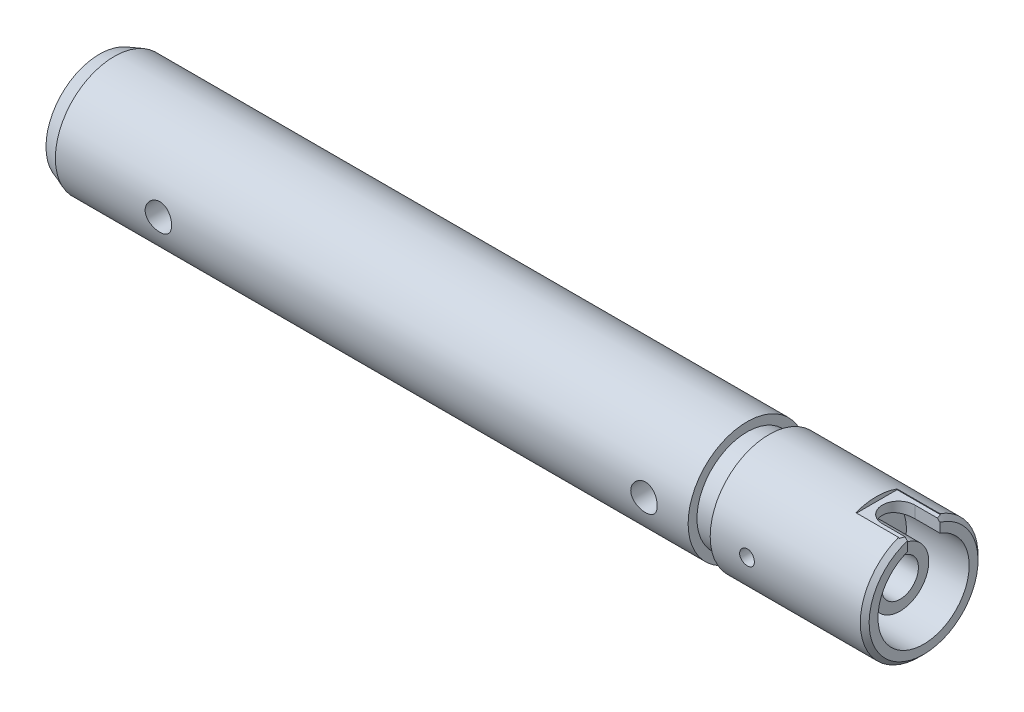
ISO-10303-21;
HEADER;
FILE_DESCRIPTION(('STEP AP214'),'2;1');
FILE_NAME('part.step','',(''),(''),'','','');
FILE_SCHEMA(('AUTOMOTIVE_DESIGN { 1 0 10303 214 1 1 1 1 }'));
ENDSEC;
DATA;
#1=APPLICATION_CONTEXT('core data for automotive mechanical design processes');
#2=APPLICATION_PROTOCOL_DEFINITION('international standard','automotive_design',2000,#1);
#3=PRODUCT_CONTEXT('',#1,'mechanical');
#4=PRODUCT('Part','Part','',(#3));
#5=PRODUCT_RELATED_PRODUCT_CATEGORY('part','',(#4));
#6=PRODUCT_DEFINITION_FORMATION('','',#4);
#7=PRODUCT_DEFINITION_CONTEXT('part definition',#1,'design');
#8=PRODUCT_DEFINITION('design','',#6,#7);
#9=PRODUCT_DEFINITION_SHAPE('','',#8);
#10=(LENGTH_UNIT() NAMED_UNIT(*) SI_UNIT(.MILLI.,.METRE.));
#11=(NAMED_UNIT(*) PLANE_ANGLE_UNIT() SI_UNIT($,.RADIAN.));
#12=(NAMED_UNIT(*) SI_UNIT($,.STERADIAN.) SOLID_ANGLE_UNIT());
#13=UNCERTAINTY_MEASURE_WITH_UNIT(LENGTH_MEASURE(1.E-05),#10,'distance_accuracy_value','');
#14=(GEOMETRIC_REPRESENTATION_CONTEXT(3) GLOBAL_UNCERTAINTY_ASSIGNED_CONTEXT((#13)) GLOBAL_UNIT_ASSIGNED_CONTEXT((#10,
#11,#12)) REPRESENTATION_CONTEXT('',''));
#15=CARTESIAN_POINT('',(0.,0.,0.));
#16=DIRECTION('',(0.,0.,1.));
#17=DIRECTION('',(1.,0.,0.));
#18=AXIS2_PLACEMENT_3D('',#15,#16,#17);
#19=CARTESIAN_POINT('',(0.,0.,8.));
#20=DIRECTION('',(-1.,0.,0.));
#21=DIRECTION('',(0.,0.,1.));
#22=AXIS2_PLACEMENT_3D('',#19,#20,#21);
#23=CYLINDRICAL_SURFACE('',#22,4.);
#24=CARTESIAN_POINT('',(71.91453,0.,4.));
#25=CARTESIAN_POINT('',(71.9145311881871,-0.0279682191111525,4.00000039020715));
#26=CARTESIAN_POINT('',(71.9168845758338,-0.0559539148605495,4.0002964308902));
#27=CARTESIAN_POINT('',(71.9262355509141,-0.111146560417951,4.00144891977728));
#28=CARTESIAN_POINT('',(71.9332379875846,-0.13835266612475,4.00230595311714));
#29=CARTESIAN_POINT('',(71.9516775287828,-0.191179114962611,4.00448387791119));
#30=CARTESIAN_POINT('',(71.9631116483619,-0.216800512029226,4.00580445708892));
#31=CARTESIAN_POINT('',(71.9900834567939,-0.265755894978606,4.00876259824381));
#32=CARTESIAN_POINT('',(72.0056204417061,-0.289090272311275,4.01040010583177));
#33=CARTESIAN_POINT('',(72.0404483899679,-0.332942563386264,4.01381935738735));
#34=CARTESIAN_POINT('',(72.0597574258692,-0.353446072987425,4.01560177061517));
#35=CARTESIAN_POINT('',(72.1015425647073,-0.390930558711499,4.0191045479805));
#36=CARTESIAN_POINT('',(72.1240188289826,-0.40791135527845,4.02082490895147));
#37=CARTESIAN_POINT('',(72.1715939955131,-0.437922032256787,4.02401538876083));
#38=CARTESIAN_POINT('',(72.1967014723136,-0.450938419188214,4.02548464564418));
#39=CARTESIAN_POINT('',(72.2487674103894,-0.472564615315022,4.02799774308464));
#40=CARTESIAN_POINT('',(72.2757258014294,-0.481174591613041,4.02904159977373));
#41=CARTESIAN_POINT('',(72.3305788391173,-0.493699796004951,4.03057932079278));
#42=CARTESIAN_POINT('',(72.3584678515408,-0.497639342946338,4.03107603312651));
#43=CARTESIAN_POINT('',(72.4145152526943,-0.500787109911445,4.03147194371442));
#44=CARTESIAN_POINT('',(72.4426736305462,-0.499995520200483,4.03137116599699));
#45=CARTESIAN_POINT('',(72.4982909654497,-0.49372344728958,4.0305860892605));
#46=CARTESIAN_POINT('',(72.52575299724,-0.488269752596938,4.02990512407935));
#47=CARTESIAN_POINT('',(72.5793690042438,-0.472870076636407,4.02804160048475));
#48=CARTESIAN_POINT('',(72.6055229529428,-0.462924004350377,4.02685903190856));
#49=CARTESIAN_POINT('',(72.6558635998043,-0.438793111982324,4.0241217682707));
#50=CARTESIAN_POINT('',(72.6800446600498,-0.424596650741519,4.02256605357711));
#51=CARTESIAN_POINT('',(72.7256913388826,-0.392376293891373,4.01925857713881));
#52=CARTESIAN_POINT('',(72.7471568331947,-0.374352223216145,4.01750680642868));
#53=CARTESIAN_POINT('',(72.7869185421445,-0.334839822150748,4.01398978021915));
#54=CARTESIAN_POINT('',(72.8051918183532,-0.313328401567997,4.01222451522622));
#55=CARTESIAN_POINT('',(72.8378717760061,-0.267531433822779,4.0088907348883));
#56=CARTESIAN_POINT('',(72.8522784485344,-0.243245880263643,4.00732221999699));
#57=CARTESIAN_POINT('',(72.8768162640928,-0.192572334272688,4.00455769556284));
#58=CARTESIAN_POINT('',(72.8869459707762,-0.166183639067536,4.00336181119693));
#59=CARTESIAN_POINT('',(72.9026240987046,-0.112061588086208,4.00147842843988));
#60=CARTESIAN_POINT('',(72.9081727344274,-0.0843282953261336,4.00079090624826));
#61=CARTESIAN_POINT('',(72.9145014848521,-0.0285026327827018,4.00000480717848));
#62=CARTESIAN_POINT('',(72.9153131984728,-0.00041389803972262,3.99990232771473));
#63=CARTESIAN_POINT('',(72.9122284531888,0.0554992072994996,4.00028732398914));
#64=CARTESIAN_POINT('',(72.9083320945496,0.0833235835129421,4.00077478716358));
#65=CARTESIAN_POINT('',(72.8959680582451,0.137824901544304,4.00228246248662));
#66=CARTESIAN_POINT('',(72.8875154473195,0.16450531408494,4.00330091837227));
#67=CARTESIAN_POINT('',(72.8662945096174,0.21606993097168,4.00575655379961));
#68=CARTESIAN_POINT('',(72.8535260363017,0.240954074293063,4.00719374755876));
#69=CARTESIAN_POINT('',(72.8239593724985,0.288360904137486,4.01033635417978));
#70=CARTESIAN_POINT('',(72.8071407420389,0.310870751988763,4.01204311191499));
#71=CARTESIAN_POINT('',(72.7699801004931,0.35275939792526,4.01552971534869));
#72=CARTESIAN_POINT('',(72.7496379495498,0.372138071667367,4.01730956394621));
#73=CARTESIAN_POINT('',(72.7058685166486,0.4073263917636,4.02075378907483));
#74=CARTESIAN_POINT('',(72.6824243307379,0.423115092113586,4.02241745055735));
#75=CARTESIAN_POINT('',(72.633198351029,0.450530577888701,4.02542917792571));
#76=CARTESIAN_POINT('',(72.6074166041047,0.462157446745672,4.02677725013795));
#77=CARTESIAN_POINT('',(72.5543149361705,0.480885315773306,4.02900029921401));
#78=CARTESIAN_POINT('',(72.5269992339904,0.48799812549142,4.02987650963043));
#79=CARTESIAN_POINT('',(72.4715495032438,0.497533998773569,4.03106016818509));
#80=CARTESIAN_POINT('',(72.4434155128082,0.499957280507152,4.03136764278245));
#81=CARTESIAN_POINT('',(72.387336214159,0.500041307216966,4.03137824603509));
#82=CARTESIAN_POINT('',(72.3593909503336,0.497734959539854,4.0310855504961));
#83=CARTESIAN_POINT('',(72.304288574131,0.488494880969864,4.0299377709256));
#84=CARTESIAN_POINT('',(72.2771314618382,0.481561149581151,4.02908268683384));
#85=CARTESIAN_POINT('',(72.2243806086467,0.46327341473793,4.0269077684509));
#86=CARTESIAN_POINT('',(72.1987863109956,0.451920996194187,4.02558810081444));
#87=CARTESIAN_POINT('',(72.1498606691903,0.425121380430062,4.02263243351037));
#88=CARTESIAN_POINT('',(72.126529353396,0.409674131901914,4.02099642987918));
#89=CARTESIAN_POINT('',(72.0826237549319,0.37500126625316,4.01757879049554));
#90=CARTESIAN_POINT('',(72.062068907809,0.355751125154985,4.01579625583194));
#91=CARTESIAN_POINT('',(72.0244686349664,0.314070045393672,4.0122943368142));
#92=CARTESIAN_POINT('',(72.0074240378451,0.291638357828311,4.01057496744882));
#93=CARTESIAN_POINT('',(71.9772729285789,0.244133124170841,4.00738588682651));
#94=CARTESIAN_POINT('',(71.9641816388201,0.219049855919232,4.0059171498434));
#95=CARTESIAN_POINT('',(71.9424157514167,0.167036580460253,4.00340470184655));
#96=CARTESIAN_POINT('',(71.9337363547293,0.140108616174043,4.00236052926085));
#97=CARTESIAN_POINT('',(71.9231181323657,0.0942011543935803,4.00106655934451));
#98=CARTESIAN_POINT('',(71.9199022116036,0.0755111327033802,4.0006685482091));
#99=CARTESIAN_POINT('',(71.9156077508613,0.0378834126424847,4.00013513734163));
#100=CARTESIAN_POINT('',(71.9145291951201,0.0189457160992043,3.99999973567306));
#101=CARTESIAN_POINT('',(71.91453,0.,4.));
#102=B_SPLINE_CURVE_WITH_KNOTS('',3,(#24,#25,#26,#27,#28,#29,#30,#31,#32,#33,#34,#35,#36,#37,
#38,#39,#40,#41,#42,#43,#44,#45,#46,#47,#48,#49,#50,#51,#52,#53,#54,#55,#56,#57,#58,#59,#60,#61,
#62,#63,#64,#65,#66,#67,#68,#69,#70,#71,#72,#73,#74,#75,#76,#77,#78,#79,#80,#81,#82,#83,#84,#85,
#86,#87,#88,#89,#90,#91,#92,#93,#94,#95,#96,#97,#98,#99,#100,#101),.UNSPECIFIED.,.T.,.F.,(4,2,2,
2,2,2,2,2,2,2,2,2,2,2,2,2,2,2,2,2,2,2,2,2,2,2,2,2,2,2,2,2,2,2,2,2,2,2,4),(0.,0.08383545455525,
0.167758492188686,0.25162510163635,0.335477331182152,0.419741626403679,0.50401021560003,
0.588562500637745,0.673111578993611,0.757218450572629,0.841321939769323,0.924945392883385,
1.00857054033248,1.09242685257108,1.17628700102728,1.26072695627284,1.34516710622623,
1.42963559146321,1.51410012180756,1.59800055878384,1.68189920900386,1.76552210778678,
1.84914784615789,1.93320480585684,2.01726510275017,2.10180394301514,2.18634108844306,
2.27065614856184,2.35496728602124,2.43869380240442,2.52242032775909,2.60611684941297,
2.68981441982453,2.77407047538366,2.85834639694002,2.9429428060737,3.02744699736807,
3.08423768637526,3.14102795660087),.UNSPECIFIED.);
#103=CARTESIAN_POINT('',(71.91453,0.,4.));
#104=VERTEX_POINT('',#103);
#105=EDGE_CURVE('E249',#104,#104,#102,.T.);
#106=ORIENTED_EDGE('',*,*,#105,.T.);
#107=EDGE_LOOP('',(#106));
#108=FACE_BOUND('',#107,.T.);
#109=CARTESIAN_POINT('',(69.91453,0.,8.));
#110=DIRECTION('',(-1.,0.,0.));
#111=DIRECTION('',(0.,0.,1.));
#112=AXIS2_PLACEMENT_3D('',#109,#110,#111);
#113=CIRCLE('',#112,4.);
#114=CARTESIAN_POINT('',(69.91453,0.,12.));
#115=VERTEX_POINT('',#114);
#116=EDGE_CURVE('E437',#115,#115,#113,.T.);
#117=ORIENTED_EDGE('',*,*,#116,.F.);
#118=EDGE_LOOP('',(#117));
#119=FACE_BOUND('',#118,.T.);
#120=CARTESIAN_POINT('',(71.91453,0.,12.));
#121=CARTESIAN_POINT('',(71.9145311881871,0.0279682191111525,11.9999996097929));
#122=CARTESIAN_POINT('',(71.9168845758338,0.0559539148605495,11.9997035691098));
#123=CARTESIAN_POINT('',(71.9262355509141,0.111146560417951,11.9985510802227));
#124=CARTESIAN_POINT('',(71.9332379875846,0.13835266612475,11.9976940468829));
#125=CARTESIAN_POINT('',(71.9516775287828,0.191179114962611,11.9955161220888));
#126=CARTESIAN_POINT('',(71.9631116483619,0.216800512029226,11.9941955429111));
#127=CARTESIAN_POINT('',(71.9900834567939,0.265755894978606,11.9912374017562));
#128=CARTESIAN_POINT('',(72.0056204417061,0.289090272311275,11.9895998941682));
#129=CARTESIAN_POINT('',(72.0404483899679,0.332942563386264,11.9861806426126));
#130=CARTESIAN_POINT('',(72.0597574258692,0.353446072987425,11.9843982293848));
#131=CARTESIAN_POINT('',(72.1015425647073,0.390930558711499,11.9808954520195));
#132=CARTESIAN_POINT('',(72.1240188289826,0.40791135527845,11.9791750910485));
#133=CARTESIAN_POINT('',(72.1715939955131,0.437922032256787,11.9759846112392));
#134=CARTESIAN_POINT('',(72.1967014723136,0.450938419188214,11.9745153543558));
#135=CARTESIAN_POINT('',(72.2487674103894,0.472564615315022,11.9720022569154));
#136=CARTESIAN_POINT('',(72.2757258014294,0.481174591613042,11.9709584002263));
#137=CARTESIAN_POINT('',(72.3305788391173,0.493699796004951,11.9694206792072));
#138=CARTESIAN_POINT('',(72.3584678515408,0.497639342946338,11.9689239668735));
#139=CARTESIAN_POINT('',(72.4145152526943,0.500787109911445,11.9685280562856));
#140=CARTESIAN_POINT('',(72.4426736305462,0.499995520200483,11.968628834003));
#141=CARTESIAN_POINT('',(72.4982909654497,0.493723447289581,11.9694139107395));
#142=CARTESIAN_POINT('',(72.52575299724,0.488269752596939,11.9700948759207));
#143=CARTESIAN_POINT('',(72.5793690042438,0.47287007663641,11.9719583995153));
#144=CARTESIAN_POINT('',(72.6055229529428,0.462924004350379,11.9731409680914));
#145=CARTESIAN_POINT('',(72.6558635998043,0.438793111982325,11.9758782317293));
#146=CARTESIAN_POINT('',(72.6800446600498,0.424596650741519,11.9774339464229));
#147=CARTESIAN_POINT('',(72.7256913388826,0.392376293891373,11.9807414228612));
#148=CARTESIAN_POINT('',(72.7471568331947,0.374352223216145,11.9824931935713));
#149=CARTESIAN_POINT('',(72.7869185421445,0.334839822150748,11.9860102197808));
#150=CARTESIAN_POINT('',(72.8051918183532,0.313328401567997,11.9877754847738));
#151=CARTESIAN_POINT('',(72.8378717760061,0.267531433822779,11.9911092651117));
#152=CARTESIAN_POINT('',(72.8522784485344,0.243245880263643,11.992677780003));
#153=CARTESIAN_POINT('',(72.8768162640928,0.192572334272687,11.9954423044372));
#154=CARTESIAN_POINT('',(72.8869459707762,0.166183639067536,11.9966381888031));
#155=CARTESIAN_POINT('',(72.9026240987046,0.112061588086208,11.9985215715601));
#156=CARTESIAN_POINT('',(72.9081727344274,0.0843282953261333,11.9992090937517));
#157=CARTESIAN_POINT('',(72.9145014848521,0.0285026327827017,11.9999951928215));
#158=CARTESIAN_POINT('',(72.9153131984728,0.000413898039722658,12.0000976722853));
#159=CARTESIAN_POINT('',(72.9122284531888,-0.0554992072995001,11.9997126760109));
#160=CARTESIAN_POINT('',(72.9083320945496,-0.0833235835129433,11.9992252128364));
#161=CARTESIAN_POINT('',(72.8959680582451,-0.137824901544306,11.9977175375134));
#162=CARTESIAN_POINT('',(72.8875154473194,-0.164505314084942,11.9966990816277));
#163=CARTESIAN_POINT('',(72.8662945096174,-0.216069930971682,11.9942434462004));
#164=CARTESIAN_POINT('',(72.8535260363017,-0.240954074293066,11.9928062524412));
#165=CARTESIAN_POINT('',(72.8239593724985,-0.288360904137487,11.9896636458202));
#166=CARTESIAN_POINT('',(72.8071407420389,-0.310870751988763,11.987956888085));
#167=CARTESIAN_POINT('',(72.7699801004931,-0.35275939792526,11.9844702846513));
#168=CARTESIAN_POINT('',(72.7496379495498,-0.372138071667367,11.9826904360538));
#169=CARTESIAN_POINT('',(72.7058685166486,-0.4073263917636,11.9792462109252));
#170=CARTESIAN_POINT('',(72.6824243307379,-0.423115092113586,11.9775825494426));
#171=CARTESIAN_POINT('',(72.633198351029,-0.450530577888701,11.9745708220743));
#172=CARTESIAN_POINT('',(72.6074166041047,-0.462157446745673,11.973222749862));
#173=CARTESIAN_POINT('',(72.5543149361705,-0.480885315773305,11.970999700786));
#174=CARTESIAN_POINT('',(72.5269992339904,-0.487998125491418,11.9701234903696));
#175=CARTESIAN_POINT('',(72.4715495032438,-0.497533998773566,11.9689398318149));
#176=CARTESIAN_POINT('',(72.4434155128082,-0.499957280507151,11.9686323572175));
#177=CARTESIAN_POINT('',(72.387336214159,-0.500041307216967,11.9686217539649));
#178=CARTESIAN_POINT('',(72.3593909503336,-0.497734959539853,11.9689144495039));
#179=CARTESIAN_POINT('',(72.304288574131,-0.488494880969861,11.9700622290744));
#180=CARTESIAN_POINT('',(72.2771314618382,-0.48156114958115,11.9709173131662));
#181=CARTESIAN_POINT('',(72.2243806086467,-0.46327341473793,11.9730922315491));
#182=CARTESIAN_POINT('',(72.1987863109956,-0.451920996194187,11.9744118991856));
#183=CARTESIAN_POINT('',(72.1498606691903,-0.425121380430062,11.9773675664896));
#184=CARTESIAN_POINT('',(72.126529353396,-0.409674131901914,11.9790035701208));
#185=CARTESIAN_POINT('',(72.0826237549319,-0.375001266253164,11.9824212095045));
#186=CARTESIAN_POINT('',(72.062068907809,-0.355751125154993,11.9842037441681));
#187=CARTESIAN_POINT('',(72.0244686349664,-0.314070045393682,11.9877056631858));
#188=CARTESIAN_POINT('',(72.0074240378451,-0.291638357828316,11.9894250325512));
#189=CARTESIAN_POINT('',(71.9772729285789,-0.244133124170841,11.9926141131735));
#190=CARTESIAN_POINT('',(71.9641816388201,-0.219049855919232,11.9940828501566));
#191=CARTESIAN_POINT('',(71.9424157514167,-0.167036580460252,11.9965952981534));
#192=CARTESIAN_POINT('',(71.9337363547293,-0.140108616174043,11.9976394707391));
#193=CARTESIAN_POINT('',(71.9231181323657,-0.0942011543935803,11.9989334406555));
#194=CARTESIAN_POINT('',(71.9199022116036,-0.0755111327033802,11.9993314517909));
#195=CARTESIAN_POINT('',(71.9156077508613,-0.0378834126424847,11.9998648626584));
#196=CARTESIAN_POINT('',(71.9145291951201,-0.0189457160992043,12.0000002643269));
#197=CARTESIAN_POINT('',(71.91453,0.,12.));
#198=B_SPLINE_CURVE_WITH_KNOTS('',3,(#120,#121,#122,#123,#124,#125,#126,#127,#128,#129,#130,
#131,#132,#133,#134,#135,#136,#137,#138,#139,#140,#141,#142,#143,#144,#145,#146,#147,#148,#149,
#150,#151,#152,#153,#154,#155,#156,#157,#158,#159,#160,#161,#162,#163,#164,#165,#166,#167,#168,
#169,#170,#171,#172,#173,#174,#175,#176,#177,#178,#179,#180,#181,#182,#183,#184,#185,#186,#187,
#188,#189,#190,#191,#192,#193,#194,#195,#196,#197),.UNSPECIFIED.,.T.,.F.,(4,2,2,2,2,2,2,2,2,2,2,
2,2,2,2,2,2,2,2,2,2,2,2,2,2,2,2,2,2,2,2,2,2,2,2,2,2,2,4),(0.,0.08383545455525,0.167758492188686,
0.25162510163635,0.335477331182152,0.419741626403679,0.50401021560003,0.588562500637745,
0.673111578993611,0.757218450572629,0.841321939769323,0.924945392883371,1.00857054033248,
1.09242685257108,1.17628700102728,1.26072695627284,1.34516710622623,1.42963559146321,
1.51410012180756,1.59800055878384,1.68189920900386,1.76552210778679,1.84914784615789,
1.93320480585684,2.01726510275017,2.10180394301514,2.18634108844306,2.27065614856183,
2.35496728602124,2.43869380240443,2.52242032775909,2.60611684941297,2.68981441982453,
2.77407047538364,2.85834639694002,2.9429428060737,3.02744699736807,3.08423768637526,
3.14102795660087),.UNSPECIFIED.);
#199=CARTESIAN_POINT('',(71.91453,0.,12.));
#200=VERTEX_POINT('',#199);
#201=EDGE_CURVE('E243',#200,#200,#198,.T.);
#202=ORIENTED_EDGE('',*,*,#201,.T.);
#203=EDGE_LOOP('',(#202));
#204=FACE_BOUND('',#203,.T.);
#205=DIRECTION('',(-1.,0.,0.));
#206=VECTOR('',#205,1.);
#207=CARTESIAN_POINT('',(0.,3.74699879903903,6.6));
#208=LINE('',#207,#206);
#209=CARTESIAN_POINT('',(77.21453,3.74699879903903,6.6));
#210=VERTEX_POINT('',#209);
#211=CARTESIAN_POINT('',(80.11453,3.74699879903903,6.6));
#212=VERTEX_POINT('',#211);
#213=EDGE_CURVE('E312',#210,#212,#208,.F.);
#214=ORIENTED_EDGE('',*,*,#213,.T.);
#215=CARTESIAN_POINT('',(80.11453,0.,8.));
#216=DIRECTION('',(1.,0.,0.));
#217=DIRECTION('',(0.,0.,-1.));
#218=AXIS2_PLACEMENT_3D('',#215,#216,#217);
#219=CIRCLE('',#218,4.);
#220=CARTESIAN_POINT('',(80.11453,3.74699879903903,9.4));
#221=VERTEX_POINT('',#220);
#222=EDGE_CURVE('E199',#212,#221,#219,.F.);
#223=ORIENTED_EDGE('',*,*,#222,.T.);
#224=DIRECTION('',(-1.,0.,0.));
#225=VECTOR('',#224,1.);
#226=CARTESIAN_POINT('',(0.,3.74699879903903,9.4));
#227=LINE('',#226,#225);
#228=CARTESIAN_POINT('',(77.21453,3.74699879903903,9.4));
#229=VERTEX_POINT('',#228);
#230=EDGE_CURVE('E315',#229,#221,#227,.F.);
#231=ORIENTED_EDGE('',*,*,#230,.F.);
#232=CARTESIAN_POINT('',(77.21453,0.,8.));
#233=DIRECTION('',(-1.,0.,0.));
#234=DIRECTION('',(0.,0.,1.));
#235=AXIS2_PLACEMENT_3D('',#232,#233,#234);
#236=CIRCLE('',#235,4.);
#237=EDGE_CURVE('E356',#210,#229,#236,.F.);
#238=ORIENTED_EDGE('',*,*,#237,.F.);
#239=EDGE_LOOP('',(#214,#223,#231,#238));
#240=FACE_BOUND('',#239,.T.);
#241=ADVANCED_FACE('F44',(#108,#119,#204,#240),#23,.T.);
#242=CARTESIAN_POINT('',(80.41453,-40.9011379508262,8.));
#243=DIRECTION('',(1.,0.,0.));
#244=DIRECTION('',(0.,0.,-1.));
#245=AXIS2_PLACEMENT_3D('',#242,#243,#244);
#246=PLANE('',#245);
#247=DIRECTION('',(0.,1.,0.));
#248=VECTOR('',#247,1.);
#249=CARTESIAN_POINT('',(80.41453,-4.001,9.1));
#250=LINE('',#249,#248);
#251=CARTESIAN_POINT('',(80.41453,2.89827534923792,9.09999999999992));
#252=VERTEX_POINT('',#251);
#253=CARTESIAN_POINT('',(80.41453,3.53270434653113,9.1));
#254=VERTEX_POINT('',#253);
#255=EDGE_CURVE('E162',#252,#254,#250,.T.);
#256=ORIENTED_EDGE('',*,*,#255,.T.);
#257=CARTESIAN_POINT('',(80.41453,0.,8.));
#258=DIRECTION('',(1.,0.,0.));
#259=DIRECTION('',(0.,0.,-1.));
#260=AXIS2_PLACEMENT_3D('',#257,#258,#259);
#261=CIRCLE('',#260,3.69999999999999);
#262=CARTESIAN_POINT('',(80.41453,3.53270434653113,6.9));
#263=VERTEX_POINT('',#262);
#264=EDGE_CURVE('E64',#254,#263,#261,.T.);
#265=ORIENTED_EDGE('',*,*,#264,.T.);
#266=DIRECTION('',(0.,1.,0.));
#267=VECTOR('',#266,1.);
#268=CARTESIAN_POINT('',(80.41453,-4.001,6.9));
#269=LINE('',#268,#267);
#270=CARTESIAN_POINT('',(80.41453,2.89827534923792,6.90000000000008));
#271=VERTEX_POINT('',#270);
#272=EDGE_CURVE('E169',#271,#263,#269,.T.);
#273=ORIENTED_EDGE('',*,*,#272,.F.);
#274=CARTESIAN_POINT('',(80.41453,0.,8.));
#275=DIRECTION('',(-1.,0.,0.));
#276=DIRECTION('',(0.,0.,1.));
#277=AXIS2_PLACEMENT_3D('',#274,#275,#276);
#278=CIRCLE('',#277,3.1);
#279=EDGE_CURVE('E151',#271,#252,#278,.T.);
#280=ORIENTED_EDGE('',*,*,#279,.T.);
#281=EDGE_LOOP('',(#256,#265,#273,#280));
#282=FACE_BOUND('',#281,.T.);
#283=ADVANCED_FACE('F226',(#282),#246,.T.);
#284=CARTESIAN_POINT('',(0.,0.,8.));
#285=DIRECTION('',(-1.,0.,0.));
#286=DIRECTION('',(0.,0.,1.));
#287=AXIS2_PLACEMENT_3D('',#284,#285,#286);
#288=CYLINDRICAL_SURFACE('',#287,1.25);
#289=CARTESIAN_POINT('',(64.51453,0.,6.75));
#290=CARTESIAN_POINT('',(64.5145277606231,0.0444675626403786,6.74999791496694));
#291=CARTESIAN_POINT('',(64.5178432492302,0.0889237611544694,6.75239171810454));
#292=CARTESIAN_POINT('',(64.5308781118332,0.17639553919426,6.76172701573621));
#293=CARTESIAN_POINT('',(64.5405995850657,0.219410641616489,6.76867000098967));
#294=CARTESIAN_POINT('',(64.5658132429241,0.302591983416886,6.78643464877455));
#295=CARTESIAN_POINT('',(64.5812766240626,0.342771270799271,6.79723694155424));
#296=CARTESIAN_POINT('',(64.6172739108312,0.419750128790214,6.82188903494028));
#297=CARTESIAN_POINT('',(64.6378085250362,0.45654922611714,6.83573926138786));
#298=CARTESIAN_POINT('',(64.6853427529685,0.529479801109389,6.86692349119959));
#299=CARTESIAN_POINT('',(64.7127582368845,0.565252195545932,6.88445897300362));
#300=CARTESIAN_POINT('',(64.7722148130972,0.632007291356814,6.92087254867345));
#301=CARTESIAN_POINT('',(64.8042628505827,0.662982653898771,6.9397526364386));
#302=CARTESIAN_POINT('',(64.8789497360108,0.725219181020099,6.98108042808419));
#303=CARTESIAN_POINT('',(64.922448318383,0.755450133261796,7.00353491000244));
#304=CARTESIAN_POINT('',(65.0150329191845,0.808227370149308,7.04584655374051));
#305=CARTESIAN_POINT('',(65.0641100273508,0.830785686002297,7.06570775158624));
#306=CARTESIAN_POINT('',(65.1505974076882,0.861221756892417,7.09386520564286));
#307=CARTESIAN_POINT('',(65.1866191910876,0.871487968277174,7.10382246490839));
#308=CARTESIAN_POINT('',(65.2604804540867,0.887519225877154,7.11969401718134));
#309=CARTESIAN_POINT('',(65.2983158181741,0.893293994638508,7.1256170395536));
#310=CARTESIAN_POINT('',(65.3751511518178,0.899968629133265,7.13248479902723));
#311=CARTESIAN_POINT('',(65.4141572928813,0.900835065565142,7.13339539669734));
#312=CARTESIAN_POINT('',(65.4917331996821,0.897524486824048,7.12996908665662));
#313=CARTESIAN_POINT('',(65.5303025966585,0.893343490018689,7.12562803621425));
#314=CARTESIAN_POINT('',(65.6104412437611,0.879472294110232,7.11166814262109));
#315=CARTESIAN_POINT('',(65.6517983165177,0.869169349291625,7.10146734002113));
#316=CARTESIAN_POINT('',(65.731649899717,0.843329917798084,7.07717430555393));
#317=CARTESIAN_POINT('',(65.7701377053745,0.827781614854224,7.0630733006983));
#318=CARTESIAN_POINT('',(65.8557956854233,0.786271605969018,7.02776793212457));
#319=CARTESIAN_POINT('',(65.9017780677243,0.758569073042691,7.00573747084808));
#320=CARTESIAN_POINT('',(65.9879081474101,0.695759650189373,6.9608102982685));
#321=CARTESIAN_POINT('',(66.0280497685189,0.660645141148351,6.93791271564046));
#322=CARTESIAN_POINT('',(66.1023306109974,0.582964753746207,6.89334693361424));
#323=CARTESIAN_POINT('',(66.1363992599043,0.540321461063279,6.87169494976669));
#324=CARTESIAN_POINT('',(66.1968063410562,0.448387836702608,6.83212257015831));
#325=CARTESIAN_POINT('',(66.223162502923,0.399113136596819,6.81419364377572));
#326=CARTESIAN_POINT('',(66.2610908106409,0.308377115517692,6.78796416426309));
#327=CARTESIAN_POINT('',(66.274720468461,0.26814593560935,6.77837370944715));
#328=CARTESIAN_POINT('',(66.2962468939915,0.185460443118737,6.76312242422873));
#329=CARTESIAN_POINT('',(66.3041478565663,0.143007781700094,6.75745871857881));
#330=CARTESIAN_POINT('',(66.3137771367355,0.0568973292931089,6.75054650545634));
#331=CARTESIAN_POINT('',(66.3154845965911,0.0132359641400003,6.74931291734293));
#332=CARTESIAN_POINT('',(66.3125574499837,-0.0737636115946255,6.75141990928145));
#333=CARTESIAN_POINT('',(66.3079223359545,-0.117101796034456,6.75476085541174));
#334=CARTESIAN_POINT('',(66.2930004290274,-0.199926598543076,6.76542110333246));
#335=CARTESIAN_POINT('',(66.2830161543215,-0.239496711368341,6.7725272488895));
#336=CARTESIAN_POINT('',(66.2580985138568,-0.316262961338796,6.7900291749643));
#337=CARTESIAN_POINT('',(66.2431641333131,-0.353458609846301,6.8004256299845));
#338=CARTESIAN_POINT('',(66.2074124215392,-0.428011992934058,6.8248502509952));
#339=CARTESIAN_POINT('',(66.1861938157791,-0.46509746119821,6.8391170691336));
#340=CARTESIAN_POINT('',(66.1392480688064,-0.535323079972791,6.86977866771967));
#341=CARTESIAN_POINT('',(66.1135176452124,-0.568460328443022,6.88617499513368));
#342=CARTESIAN_POINT('',(66.0530236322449,-0.636198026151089,6.9231997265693));
#343=CARTESIAN_POINT('',(66.0174682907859,-0.669967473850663,6.94405531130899));
#344=CARTESIAN_POINT('',(65.9412894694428,-0.73138293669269,6.98562659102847));
#345=CARTESIAN_POINT('',(65.900662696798,-0.759024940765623,7.00634218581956));
#346=CARTESIAN_POINT('',(65.820671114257,-0.804271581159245,7.04272902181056));
#347=CARTESIAN_POINT('',(65.7819345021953,-0.822741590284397,7.05869979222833));
#348=CARTESIAN_POINT('',(65.7011339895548,-0.854241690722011,7.08718935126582));
#349=CARTESIAN_POINT('',(65.6590773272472,-0.86728324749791,7.09971539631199));
#350=CARTESIAN_POINT('',(65.580908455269,-0.885206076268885,7.11736904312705));
#351=CARTESIAN_POINT('',(65.5452765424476,-0.891194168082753,7.12347238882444));
#352=CARTESIAN_POINT('',(65.473090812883,-0.898823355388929,7.13129488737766));
#353=CARTESIAN_POINT('',(65.4365382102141,-0.900469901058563,7.13301953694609));
#354=CARTESIAN_POINT('',(65.3635626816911,-0.899297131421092,7.13180363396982));
#355=CARTESIAN_POINT('',(65.3271398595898,-0.896474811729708,7.12885994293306));
#356=CARTESIAN_POINT('',(65.2554531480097,-0.886571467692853,7.11878565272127));
#357=CARTESIAN_POINT('',(65.2201911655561,-0.87948377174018,7.11164849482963));
#358=CARTESIAN_POINT('',(65.1403792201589,-0.858518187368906,7.09130826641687));
#359=CARTESIAN_POINT('',(65.0965290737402,-0.843183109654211,7.07688828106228));
#360=CARTESIAN_POINT('',(65.0126786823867,-0.806608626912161,7.04476478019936));
#361=CARTESIAN_POINT('',(64.9726850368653,-0.785359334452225,7.02705578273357));
#362=CARTESIAN_POINT('',(64.895676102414,-0.736829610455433,6.98977968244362));
#363=CARTESIAN_POINT('',(64.8587760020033,-0.709396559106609,6.97017436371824));
#364=CARTESIAN_POINT('',(64.789488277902,-0.649176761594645,6.93118833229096));
#365=CARTESIAN_POINT('',(64.7571022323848,-0.616388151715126,6.91180770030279));
#366=CARTESIAN_POINT('',(64.691595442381,-0.538894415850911,6.87112667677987));
#367=CARTESIAN_POINT('',(64.6595182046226,-0.493109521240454,6.85016774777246));
#368=CARTESIAN_POINT('',(64.6038548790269,-0.394935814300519,6.81287364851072));
#369=CARTESIAN_POINT('',(64.580257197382,-0.342556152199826,6.79653217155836));
#370=CARTESIAN_POINT('',(64.5463775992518,-0.24211955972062,6.77277947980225));
#371=CARTESIAN_POINT('',(64.5345111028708,-0.194848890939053,6.76432055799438));
#372=CARTESIAN_POINT('',(64.5185935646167,-0.0983791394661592,6.75293552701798));
#373=CARTESIAN_POINT('',(64.514532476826,-0.0491826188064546,6.75000230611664));
#374=CARTESIAN_POINT('',(64.51453,0.,6.75));
#375=B_SPLINE_CURVE_WITH_KNOTS('',3,(#289,#290,#291,#292,#293,#294,#295,#296,#297,#298,#299,
#300,#301,#302,#303,#304,#305,#306,#307,#308,#309,#310,#311,#312,#313,#314,#315,#316,#317,#318,
#319,#320,#321,#322,#323,#324,#325,#326,#327,#328,#329,#330,#331,#332,#333,#334,#335,#336,#337,
#338,#339,#340,#341,#342,#343,#344,#345,#346,#347,#348,#349,#350,#351,#352,#353,#354,#355,#356,
#357,#358,#359,#360,#361,#362,#363,#364,#365,#366,#367,#368,#369,#370,#371,#372,#373,#374),
.UNSPECIFIED.,.T.,.F.,(4,2,2,2,2,2,2,2,2,2,2,2,2,2,2,2,2,2,2,2,2,2,2,2,2,2,2,2,2,2,2,2,2,2,2,2,
2,2,2,2,2,2,4),(0.,0.133203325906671,0.266450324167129,0.399037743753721,0.531643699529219,
0.676200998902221,0.820977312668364,0.992832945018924,1.16441784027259,1.28026783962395,
1.39586635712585,1.51225124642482,1.62872800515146,1.7594889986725,1.89054654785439,
2.06374715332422,2.23712667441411,2.4124055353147,2.58727823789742,2.71737249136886,
2.84737138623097,2.97780767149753,3.10825439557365,3.23200092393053,3.35577283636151,
3.49040730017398,3.62514012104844,3.78439006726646,3.94374395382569,4.08065343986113,
4.21727227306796,4.32673237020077,4.43605499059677,4.54545113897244,4.65501884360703,
4.80014667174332,4.94551859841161,5.09497317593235,5.24447987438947,5.42257264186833,
5.60042097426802,5.74793831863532,5.89526567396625),.UNSPECIFIED.);
#376=CARTESIAN_POINT('',(64.51453,0.,6.75));
#377=VERTEX_POINT('',#376);
#378=EDGE_CURVE('E305',#377,#377,#375,.T.);
#379=ORIENTED_EDGE('',*,*,#378,.T.);
#380=EDGE_LOOP('',(#379));
#381=FACE_BOUND('',#380,.T.);
#382=CARTESIAN_POINT('',(71.91453,0.,6.75));
#383=CARTESIAN_POINT('',(71.9145324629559,0.0268732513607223,6.75000182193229));
#384=CARTESIAN_POINT('',(71.9167094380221,0.0537931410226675,6.75087676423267));
#385=CARTESIAN_POINT('',(71.9253419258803,0.106874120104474,6.75429136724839));
#386=CARTESIAN_POINT('',(71.9318090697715,0.133032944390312,6.75683555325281));
#387=CARTESIAN_POINT('',(71.9487490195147,0.183738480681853,6.7633144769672));
#388=CARTESIAN_POINT('',(71.9592087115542,0.208290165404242,6.76724465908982));
#389=CARTESIAN_POINT('',(71.9837847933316,0.255267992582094,6.7761084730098));
#390=CARTESIAN_POINT('',(71.9978999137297,0.277694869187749,6.78104175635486));
#391=CARTESIAN_POINT('',(72.0300888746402,0.320875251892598,6.79167278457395));
#392=CARTESIAN_POINT('',(72.04830666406,0.341515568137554,6.79739425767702));
#393=CARTESIAN_POINT('',(72.0878800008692,0.379543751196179,6.80884855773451));
#394=CARTESIAN_POINT('',(72.1092370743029,0.396930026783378,6.81458138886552));
#395=CARTESIAN_POINT('',(72.1556370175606,0.428718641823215,6.82569302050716));
#396=CARTESIAN_POINT('',(72.1808016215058,0.442953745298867,6.83104471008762));
#397=CARTESIAN_POINT('',(72.233414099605,0.466938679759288,6.84041588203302));
#398=CARTESIAN_POINT('',(72.2608608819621,0.476690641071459,6.84443599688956));
#399=CARTESIAN_POINT('',(72.315958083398,0.490974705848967,6.85043410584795));
#400=CARTESIAN_POINT('',(72.343542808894,0.495723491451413,6.85249644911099));
#401=CARTESIAN_POINT('',(72.3991887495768,0.500543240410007,6.85458998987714));
#402=CARTESIAN_POINT('',(72.4272497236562,0.500616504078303,6.85462218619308));
#403=CARTESIAN_POINT('',(72.4809691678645,0.496247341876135,6.85272374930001));
#404=CARTESIAN_POINT('',(72.5066589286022,0.492118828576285,6.85092956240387));
#405=CARTESIAN_POINT('',(72.5569448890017,0.479986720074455,6.84580953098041));
#406=CARTESIAN_POINT('',(72.5815408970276,0.471982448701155,6.84248341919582));
#407=CARTESIAN_POINT('',(72.629534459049,0.452173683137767,6.83460128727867));
#408=CARTESIAN_POINT('',(72.6528973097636,0.440294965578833,6.83002155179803));
#409=CARTESIAN_POINT('',(72.6973839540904,0.41312661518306,6.82015470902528));
#410=CARTESIAN_POINT('',(72.7185069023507,0.397835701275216,6.81486733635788));
#411=CARTESIAN_POINT('',(72.7596324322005,0.362887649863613,6.80368315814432));
#412=CARTESIAN_POINT('',(72.7794221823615,0.342984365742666,6.79777083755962));
#413=CARTESIAN_POINT('',(72.8154511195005,0.300078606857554,6.78635043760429));
#414=CARTESIAN_POINT('',(72.8316895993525,0.27707551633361,6.78084243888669));
#415=CARTESIAN_POINT('',(72.8604343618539,0.22801941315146,6.77071329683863));
#416=CARTESIAN_POINT('',(72.8728605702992,0.201915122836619,6.76611182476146));
#417=CARTESIAN_POINT('',(72.8930719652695,0.147755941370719,6.7584629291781));
#418=CARTESIAN_POINT('',(72.9008595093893,0.119702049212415,6.75541471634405));
#419=CARTESIAN_POINT('',(72.9111420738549,0.0642239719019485,6.75135965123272));
#420=CARTESIAN_POINT('',(72.9139231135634,0.0368608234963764,6.75024263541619));
#421=CARTESIAN_POINT('',(72.9149582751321,-0.0179613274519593,6.74982880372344));
#422=CARTESIAN_POINT('',(72.9132135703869,-0.0454203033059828,6.75053151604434));
#423=CARTESIAN_POINT('',(72.905457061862,-0.0983581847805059,6.75360608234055));
#424=CARTESIAN_POINT('',(72.8996405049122,-0.123870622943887,6.75590152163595));
#425=CARTESIAN_POINT('',(72.8841710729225,-0.173533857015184,6.76185139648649));
#426=CARTESIAN_POINT('',(72.8745177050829,-0.19768447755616,6.76550600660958));
#427=CARTESIAN_POINT('',(72.8513337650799,-0.244769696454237,6.77395851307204));
#428=CARTESIAN_POINT('',(72.8376936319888,-0.26764450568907,6.77878796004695));
#429=CARTESIAN_POINT('',(72.807044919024,-0.310860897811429,6.78906658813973));
#430=CARTESIAN_POINT('',(72.7900349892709,-0.331201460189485,6.79451601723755));
#431=CARTESIAN_POINT('',(72.7518124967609,-0.370180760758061,6.80588720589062));
#432=CARTESIAN_POINT('',(72.730396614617,-0.388618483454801,6.81181639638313));
#433=CARTESIAN_POINT('',(72.6846699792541,-0.421687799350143,6.82314581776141));
#434=CARTESIAN_POINT('',(72.6603587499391,-0.436318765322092,6.82854596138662));
#435=CARTESIAN_POINT('',(72.6091645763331,-0.461451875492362,6.83821425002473));
#436=CARTESIAN_POINT('',(72.5822590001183,-0.471912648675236,6.84247092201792));
#437=CARTESIAN_POINT('',(72.5268465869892,-0.488074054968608,6.84919081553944));
#438=CARTESIAN_POINT('',(72.4983409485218,-0.493778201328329,6.851655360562));
#439=CARTESIAN_POINT('',(72.4427480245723,-0.499928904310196,6.85432060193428));
#440=CARTESIAN_POINT('',(72.4157062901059,-0.5007242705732,6.85467144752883));
#441=CARTESIAN_POINT('',(72.3618937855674,-0.497950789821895,6.853462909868));
#442=CARTESIAN_POINT('',(72.3351229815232,-0.494382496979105,6.85190376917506));
#443=CARTESIAN_POINT('',(72.2836969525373,-0.483267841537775,6.84718337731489));
#444=CARTESIAN_POINT('',(72.258999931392,-0.475884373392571,6.84408792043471));
#445=CARTESIAN_POINT('',(72.2111853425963,-0.457501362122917,6.83668999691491));
#446=CARTESIAN_POINT('',(72.1880682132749,-0.446500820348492,6.83238719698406));
#447=CARTESIAN_POINT('',(72.1426275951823,-0.420468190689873,6.82275347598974));
#448=CARTESIAN_POINT('',(72.1204253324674,-0.40524133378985,6.81737779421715));
#449=CARTESIAN_POINT('',(72.078781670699,-0.371473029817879,6.80634048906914));
#450=CARTESIAN_POINT('',(72.0593411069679,-0.352930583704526,6.80067877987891));
#451=CARTESIAN_POINT('',(72.0224792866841,-0.311626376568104,6.78926608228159));
#452=CARTESIAN_POINT('',(72.0052706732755,-0.288669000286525,6.78353310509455));
#453=CARTESIAN_POINT('',(71.9749457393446,-0.239975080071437,6.77299898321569));
#454=CARTESIAN_POINT('',(71.9618313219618,-0.214237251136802,6.76819827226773));
#455=CARTESIAN_POINT('',(71.9403744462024,-0.161184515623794,6.76015071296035));
#456=CARTESIAN_POINT('',(71.9319476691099,-0.133907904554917,6.75687659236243));
#457=CARTESIAN_POINT('',(71.9198702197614,-0.0782191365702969,6.75213923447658));
#458=CARTESIAN_POINT('',(71.916204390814,-0.0498108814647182,6.7506702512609));
#459=CARTESIAN_POINT('',(71.9146811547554,-0.0142280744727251,6.75006025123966));
#460=CARTESIAN_POINT('',(71.9145293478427,-0.00711567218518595,6.74999951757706));
#461=CARTESIAN_POINT('',(71.91453,0.,6.75));
#462=B_SPLINE_CURVE_WITH_KNOTS('',3,(#382,#383,#384,#385,#386,#387,#388,#389,#390,#391,#392,
#393,#394,#395,#396,#397,#398,#399,#400,#401,#402,#403,#404,#405,#406,#407,#408,#409,#410,#411,
#412,#413,#414,#415,#416,#417,#418,#419,#420,#421,#422,#423,#424,#425,#426,#427,#428,#429,#430,
#431,#432,#433,#434,#435,#436,#437,#438,#439,#440,#441,#442,#443,#444,#445,#446,#447,#448,#449,
#450,#451,#452,#453,#454,#455,#456,#457,#458,#459,#460,#461),.UNSPECIFIED.,.T.,.F.,(4,2,2,2,2,2,
2,2,2,2,2,2,2,2,2,2,2,2,2,2,2,2,2,2,2,2,2,2,2,2,2,2,2,2,2,2,2,2,2,4),(0.,0.0806007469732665,
0.161420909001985,0.241977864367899,0.322506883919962,0.406493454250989,0.490520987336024,
0.578288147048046,0.666013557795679,0.749760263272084,0.833465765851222,0.911345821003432,
0.989239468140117,1.06872281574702,1.14823605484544,1.23389587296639,1.31957273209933,
1.40694228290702,1.49426739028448,1.57642296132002,1.65855723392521,1.73700113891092,
1.8154551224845,1.89630878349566,1.97719489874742,2.06342118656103,2.14966167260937,
2.23673761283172,2.32374918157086,2.4044991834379,2.48523893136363,2.56278579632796,
2.64035408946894,2.72236367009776,2.80439800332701,2.89175105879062,2.97914465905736,
3.06491075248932,3.15040313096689,3.17174511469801),.UNSPECIFIED.);
#463=CARTESIAN_POINT('',(71.91453,0.,6.75));
#464=VERTEX_POINT('',#463);
#465=EDGE_CURVE('E254',#464,#464,#462,.T.);
#466=ORIENTED_EDGE('',*,*,#465,.T.);
#467=EDGE_LOOP('',(#466));
#468=FACE_BOUND('',#467,.T.);
#469=CARTESIAN_POINT('',(62.9091778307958,0.,8.));
#470=DIRECTION('',(-1.,0.,0.));
#471=DIRECTION('',(0.,0.,1.));
#472=AXIS2_PLACEMENT_3D('',#469,#470,#471);
#473=CIRCLE('',#472,1.25);
#474=CARTESIAN_POINT('',(62.9091778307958,0.,9.25));
#475=VERTEX_POINT('',#474);
#476=EDGE_CURVE('E417',#475,#475,#473,.T.);
#477=ORIENTED_EDGE('',*,*,#476,.T.);
#478=EDGE_LOOP('',(#477));
#479=FACE_BOUND('',#478,.T.);
#480=CARTESIAN_POINT('',(78.81453,0.,8.));
#481=DIRECTION('',(-1.,0.,0.));
#482=DIRECTION('',(0.,0.,1.));
#483=AXIS2_PLACEMENT_3D('',#480,#481,#482);
#484=CIRCLE('',#483,1.25);
#485=CARTESIAN_POINT('',(78.81453,0.,9.25));
#486=VERTEX_POINT('',#485);
#487=EDGE_CURVE('E421',#486,#486,#484,.T.);
#488=ORIENTED_EDGE('',*,*,#487,.F.);
#489=EDGE_LOOP('',(#488));
#490=FACE_BOUND('',#489,.T.);
#491=CARTESIAN_POINT('',(72.91453,0.,9.25));
#492=CARTESIAN_POINT('',(72.9145275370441,0.0268732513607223,9.24999817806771));
#493=CARTESIAN_POINT('',(72.9123505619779,0.0537931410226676,9.24912323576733));
#494=CARTESIAN_POINT('',(72.9037180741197,0.106874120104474,9.24570863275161));
#495=CARTESIAN_POINT('',(72.8972509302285,0.133032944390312,9.24316444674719));
#496=CARTESIAN_POINT('',(72.8803109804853,0.183738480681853,9.2366855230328));
#497=CARTESIAN_POINT('',(72.8698512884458,0.208290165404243,9.23275534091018));
#498=CARTESIAN_POINT('',(72.8452752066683,0.255267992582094,9.2238915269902));
#499=CARTESIAN_POINT('',(72.8311600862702,0.277694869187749,9.21895824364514));
#500=CARTESIAN_POINT('',(72.7989711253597,0.320875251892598,9.20832721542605));
#501=CARTESIAN_POINT('',(72.7807533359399,0.341515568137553,9.20260574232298));
#502=CARTESIAN_POINT('',(72.7411799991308,0.379543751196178,9.19115144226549));
#503=CARTESIAN_POINT('',(72.719822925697,0.396930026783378,9.18541861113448));
#504=CARTESIAN_POINT('',(72.6734229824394,0.428718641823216,9.17430697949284));
#505=CARTESIAN_POINT('',(72.6482583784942,0.442953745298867,9.16895528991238));
#506=CARTESIAN_POINT('',(72.595645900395,0.466938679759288,9.15958411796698));
#507=CARTESIAN_POINT('',(72.5681991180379,0.476690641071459,9.15556400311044));
#508=CARTESIAN_POINT('',(72.5131019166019,0.490974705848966,9.14956589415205));
#509=CARTESIAN_POINT('',(72.4855171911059,0.495723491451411,9.14750355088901));
#510=CARTESIAN_POINT('',(72.4298712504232,0.500543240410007,9.14541001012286));
#511=CARTESIAN_POINT('',(72.4018102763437,0.500616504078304,9.14537781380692));
#512=CARTESIAN_POINT('',(72.3480908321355,0.496247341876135,9.14727625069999));
#513=CARTESIAN_POINT('',(72.3224010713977,0.492118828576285,9.14907043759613));
#514=CARTESIAN_POINT('',(72.2721151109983,0.479986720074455,9.15419046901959));
#515=CARTESIAN_POINT('',(72.2475191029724,0.471982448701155,9.15751658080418));
#516=CARTESIAN_POINT('',(72.199525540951,0.452173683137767,9.16539871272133));
#517=CARTESIAN_POINT('',(72.1761626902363,0.440294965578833,9.16997844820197));
#518=CARTESIAN_POINT('',(72.1316760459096,0.41312661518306,9.17984529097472));
#519=CARTESIAN_POINT('',(72.1105530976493,0.397835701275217,9.18513266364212));
#520=CARTESIAN_POINT('',(72.0694275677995,0.362887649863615,9.19631684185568));
#521=CARTESIAN_POINT('',(72.0496378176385,0.342984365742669,9.20222916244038));
#522=CARTESIAN_POINT('',(72.0136088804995,0.300078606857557,9.21364956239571));
#523=CARTESIAN_POINT('',(71.9973704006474,0.277075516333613,9.21915756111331));
#524=CARTESIAN_POINT('',(71.968625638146,0.228019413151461,9.22928670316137));
#525=CARTESIAN_POINT('',(71.9561994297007,0.201915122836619,9.23388817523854));
#526=CARTESIAN_POINT('',(71.9359880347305,0.147755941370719,9.2415370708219));
#527=CARTESIAN_POINT('',(71.9282004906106,0.119702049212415,9.24458528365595));
#528=CARTESIAN_POINT('',(71.9179179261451,0.0642239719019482,9.24864034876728));
#529=CARTESIAN_POINT('',(71.9151368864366,0.036860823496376,9.24975736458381));
#530=CARTESIAN_POINT('',(71.9141017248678,-0.0179613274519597,9.25017119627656));
#531=CARTESIAN_POINT('',(71.9158464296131,-0.0454203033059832,9.24946848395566));
#532=CARTESIAN_POINT('',(71.923602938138,-0.0983581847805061,9.24639391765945));
#533=CARTESIAN_POINT('',(71.9294194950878,-0.123870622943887,9.24409847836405));
#534=CARTESIAN_POINT('',(71.9448889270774,-0.173533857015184,9.23814860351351));
#535=CARTESIAN_POINT('',(71.954542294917,-0.197684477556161,9.23449399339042));
#536=CARTESIAN_POINT('',(71.9777262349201,-0.244769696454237,9.22604148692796));
#537=CARTESIAN_POINT('',(71.9913663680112,-0.26764450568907,9.22121203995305));
#538=CARTESIAN_POINT('',(72.022015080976,-0.310860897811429,9.21093341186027));
#539=CARTESIAN_POINT('',(72.0390250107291,-0.331201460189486,9.20548398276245));
#540=CARTESIAN_POINT('',(72.0772475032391,-0.370180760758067,9.19411279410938));
#541=CARTESIAN_POINT('',(72.098663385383,-0.388618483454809,9.18818360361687));
#542=CARTESIAN_POINT('',(72.1443900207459,-0.421687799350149,9.17685418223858));
#543=CARTESIAN_POINT('',(72.1687012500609,-0.436318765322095,9.17145403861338));
#544=CARTESIAN_POINT('',(72.2198954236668,-0.461451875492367,9.16178574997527));
#545=CARTESIAN_POINT('',(72.2468009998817,-0.471912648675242,9.15752907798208));
#546=CARTESIAN_POINT('',(72.3022134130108,-0.488074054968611,9.15080918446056));
#547=CARTESIAN_POINT('',(72.3307190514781,-0.49377820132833,9.148344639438));
#548=CARTESIAN_POINT('',(72.3863119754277,-0.499928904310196,9.14567939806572));
#549=CARTESIAN_POINT('',(72.413353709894,-0.5007242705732,9.14532855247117));
#550=CARTESIAN_POINT('',(72.4671662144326,-0.497950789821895,9.146537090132));
#551=CARTESIAN_POINT('',(72.4939370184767,-0.494382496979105,9.14809623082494));
#552=CARTESIAN_POINT('',(72.5453630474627,-0.483267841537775,9.15281662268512));
#553=CARTESIAN_POINT('',(72.5700600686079,-0.475884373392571,9.15591207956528));
#554=CARTESIAN_POINT('',(72.6178746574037,-0.457501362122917,9.16331000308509));
#555=CARTESIAN_POINT('',(72.640991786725,-0.446500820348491,9.16761280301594));
#556=CARTESIAN_POINT('',(72.6864324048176,-0.420468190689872,9.17724652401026));
#557=CARTESIAN_POINT('',(72.7086346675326,-0.405241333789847,9.18262220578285));
#558=CARTESIAN_POINT('',(72.750278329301,-0.371473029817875,9.19365951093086));
#559=CARTESIAN_POINT('',(72.7697188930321,-0.352930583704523,9.19932122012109));
#560=CARTESIAN_POINT('',(72.8065807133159,-0.311626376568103,9.21073391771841));
#561=CARTESIAN_POINT('',(72.8237893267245,-0.288669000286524,9.21646689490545));
#562=CARTESIAN_POINT('',(72.8541142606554,-0.239975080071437,9.22700101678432));
#563=CARTESIAN_POINT('',(72.8672286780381,-0.214237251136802,9.23180172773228));
#564=CARTESIAN_POINT('',(72.8886855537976,-0.161184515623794,9.23984928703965));
#565=CARTESIAN_POINT('',(72.8971123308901,-0.133907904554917,9.24312340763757));
#566=CARTESIAN_POINT('',(72.9091897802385,-0.0782191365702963,9.24786076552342));
#567=CARTESIAN_POINT('',(72.9128556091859,-0.0498108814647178,9.2493297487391));
#568=CARTESIAN_POINT('',(72.9143788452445,-0.0142280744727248,9.24993974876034));
#569=CARTESIAN_POINT('',(72.9145306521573,-0.0071156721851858,9.25000048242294));
#570=CARTESIAN_POINT('',(72.91453,0.,9.25));
#571=B_SPLINE_CURVE_WITH_KNOTS('',3,(#491,#492,#493,#494,#495,#496,#497,#498,#499,#500,#501,
#502,#503,#504,#505,#506,#507,#508,#509,#510,#511,#512,#513,#514,#515,#516,#517,#518,#519,#520,
#521,#522,#523,#524,#525,#526,#527,#528,#529,#530,#531,#532,#533,#534,#535,#536,#537,#538,#539,
#540,#541,#542,#543,#544,#545,#546,#547,#548,#549,#550,#551,#552,#553,#554,#555,#556,#557,#558,
#559,#560,#561,#562,#563,#564,#565,#566,#567,#568,#569,#570),.UNSPECIFIED.,.T.,.F.,(4,2,2,2,2,2,
2,2,2,2,2,2,2,2,2,2,2,2,2,2,2,2,2,2,2,2,2,2,2,2,2,2,2,2,2,2,2,2,2,4),(0.,0.0806007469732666,
0.161420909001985,0.241977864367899,0.322506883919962,0.406493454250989,0.490520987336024,
0.578288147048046,0.666013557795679,0.74976026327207,0.833465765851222,0.911345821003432,
0.989239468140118,1.06872281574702,1.14823605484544,1.23389587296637,1.31957273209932,
1.40694228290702,1.49426739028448,1.57642296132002,1.65855723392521,1.73700113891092,
1.81545512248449,1.89630878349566,1.97719489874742,2.06342118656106,2.14966167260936,
2.23673761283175,2.32374918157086,2.4044991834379,2.48523893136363,2.56278579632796,
2.64035408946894,2.72236367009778,2.80439800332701,2.89175105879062,2.97914465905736,
3.06491075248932,3.15040313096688,3.17174511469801),.UNSPECIFIED.);
#572=CARTESIAN_POINT('',(72.91453,0.,9.25));
#573=VERTEX_POINT('',#572);
#574=EDGE_CURVE('E285',#573,#573,#571,.T.);
#575=ORIENTED_EDGE('',*,*,#574,.T.);
#576=EDGE_LOOP('',(#575));
#577=FACE_BOUND('',#576,.T.);
#578=CARTESIAN_POINT('',(66.31453,0.,9.25));
#579=CARTESIAN_POINT('',(66.3145322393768,0.0444675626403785,9.25000208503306));
#580=CARTESIAN_POINT('',(66.3112167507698,0.0889237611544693,9.24760828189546));
#581=CARTESIAN_POINT('',(66.2981818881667,0.17639553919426,9.23827298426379));
#582=CARTESIAN_POINT('',(66.2884604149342,0.219410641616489,9.23132999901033));
#583=CARTESIAN_POINT('',(66.2632467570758,0.302591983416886,9.21356535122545));
#584=CARTESIAN_POINT('',(66.2477833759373,0.342771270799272,9.20276305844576));
#585=CARTESIAN_POINT('',(66.2117860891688,0.419750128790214,9.17811096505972));
#586=CARTESIAN_POINT('',(66.1912514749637,0.45654922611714,9.16426073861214));
#587=CARTESIAN_POINT('',(66.1437172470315,0.529479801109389,9.13307650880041));
#588=CARTESIAN_POINT('',(66.1163017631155,0.565252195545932,9.11554102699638));
#589=CARTESIAN_POINT('',(66.0568451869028,0.632007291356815,9.07912745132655));
#590=CARTESIAN_POINT('',(66.0247971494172,0.662982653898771,9.06024736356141));
#591=CARTESIAN_POINT('',(65.9501102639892,0.725219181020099,9.01891957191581));
#592=CARTESIAN_POINT('',(65.906611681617,0.755450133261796,8.99646508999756));
#593=CARTESIAN_POINT('',(65.8140270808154,0.808227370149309,8.95415344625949));
#594=CARTESIAN_POINT('',(65.7649499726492,0.830785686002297,8.93429224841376));
#595=CARTESIAN_POINT('',(65.6784625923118,0.861221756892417,8.90613479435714));
#596=CARTESIAN_POINT('',(65.6424408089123,0.871487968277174,8.89617753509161));
#597=CARTESIAN_POINT('',(65.5685795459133,0.887519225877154,8.88030598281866));
#598=CARTESIAN_POINT('',(65.5307441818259,0.893293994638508,8.8743829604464));
#599=CARTESIAN_POINT('',(65.4539088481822,0.899968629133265,8.86751520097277));
#600=CARTESIAN_POINT('',(65.4149027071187,0.900835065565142,8.86660460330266));
#601=CARTESIAN_POINT('',(65.3373268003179,0.897524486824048,8.87003091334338));
#602=CARTESIAN_POINT('',(65.2987574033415,0.893343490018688,8.87437196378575));
#603=CARTESIAN_POINT('',(65.2186187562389,0.879472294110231,8.88833185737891));
#604=CARTESIAN_POINT('',(65.1772616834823,0.869169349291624,8.89853265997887));
#605=CARTESIAN_POINT('',(65.097410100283,0.843329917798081,8.92282569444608));
#606=CARTESIAN_POINT('',(65.0589222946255,0.827781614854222,8.9369266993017));
#607=CARTESIAN_POINT('',(64.9732643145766,0.786271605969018,8.97223206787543));
#608=CARTESIAN_POINT('',(64.9272819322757,0.758569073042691,8.99426252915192));
#609=CARTESIAN_POINT('',(64.8411518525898,0.695759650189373,9.0391897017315));
#610=CARTESIAN_POINT('',(64.801010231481,0.660645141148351,9.06208728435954));
#611=CARTESIAN_POINT('',(64.7267293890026,0.582964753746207,9.10665306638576));
#612=CARTESIAN_POINT('',(64.6926607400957,0.540321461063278,9.12830505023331));
#613=CARTESIAN_POINT('',(64.6322536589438,0.448387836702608,9.16787742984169));
#614=CARTESIAN_POINT('',(64.6058974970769,0.399113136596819,9.18580635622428));
#615=CARTESIAN_POINT('',(64.5679691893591,0.308377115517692,9.21203583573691));
#616=CARTESIAN_POINT('',(64.554339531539,0.26814593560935,9.22162629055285));
#617=CARTESIAN_POINT('',(64.5328131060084,0.185460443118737,9.23687757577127));
#618=CARTESIAN_POINT('',(64.5249121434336,0.143007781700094,9.24254128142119));
#619=CARTESIAN_POINT('',(64.5152828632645,0.0568973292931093,9.24945349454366));
#620=CARTESIAN_POINT('',(64.5135754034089,0.0132359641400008,9.25068708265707));
#621=CARTESIAN_POINT('',(64.5165025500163,-0.073763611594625,9.24858009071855));
#622=CARTESIAN_POINT('',(64.5211376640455,-0.117101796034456,9.24523914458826));
#623=CARTESIAN_POINT('',(64.5360595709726,-0.199926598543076,9.23457889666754));
#624=CARTESIAN_POINT('',(64.5460438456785,-0.239496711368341,9.2274727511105));
#625=CARTESIAN_POINT('',(64.5709614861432,-0.316262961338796,9.2099708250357));
#626=CARTESIAN_POINT('',(64.5858958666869,-0.353458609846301,9.1995743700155));
#627=CARTESIAN_POINT('',(64.6216475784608,-0.428011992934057,9.1751497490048));
#628=CARTESIAN_POINT('',(64.6428661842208,-0.46509746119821,9.1608829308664));
#629=CARTESIAN_POINT('',(64.6898119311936,-0.535323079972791,9.13022133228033));
#630=CARTESIAN_POINT('',(64.7155423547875,-0.568460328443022,9.11382500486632));
#631=CARTESIAN_POINT('',(64.7760363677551,-0.63619802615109,9.0768002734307));
#632=CARTESIAN_POINT('',(64.811591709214,-0.669967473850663,9.05594468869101));
#633=CARTESIAN_POINT('',(64.8877705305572,-0.73138293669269,9.01437340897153));
#634=CARTESIAN_POINT('',(64.928397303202,-0.759024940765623,8.99365781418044));
#635=CARTESIAN_POINT('',(65.0083888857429,-0.804271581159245,8.95727097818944));
#636=CARTESIAN_POINT('',(65.0471254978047,-0.822741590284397,8.94130020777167));
#637=CARTESIAN_POINT('',(65.1279260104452,-0.854241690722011,8.91281064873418));
#638=CARTESIAN_POINT('',(65.1699826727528,-0.86728324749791,8.90028460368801));
#639=CARTESIAN_POINT('',(65.248151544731,-0.885206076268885,8.88263095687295));
#640=CARTESIAN_POINT('',(65.2837834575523,-0.891194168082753,8.87652761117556));
#641=CARTESIAN_POINT('',(65.355969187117,-0.898823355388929,8.86870511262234));
#642=CARTESIAN_POINT('',(65.3925217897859,-0.900469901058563,8.86698046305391));
#643=CARTESIAN_POINT('',(65.4654973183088,-0.899297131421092,8.86819636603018));
#644=CARTESIAN_POINT('',(65.5019201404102,-0.896474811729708,8.87114005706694));
#645=CARTESIAN_POINT('',(65.5736068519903,-0.886571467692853,8.88121434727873));
#646=CARTESIAN_POINT('',(65.6088688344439,-0.879483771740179,8.88835150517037));
#647=CARTESIAN_POINT('',(65.6886807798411,-0.858518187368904,8.90869173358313));
#648=CARTESIAN_POINT('',(65.7325309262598,-0.843183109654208,8.92311171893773));
#649=CARTESIAN_POINT('',(65.8163813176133,-0.806608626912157,8.95523521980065));
#650=CARTESIAN_POINT('',(65.8563749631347,-0.785359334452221,8.97294421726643));
#651=CARTESIAN_POINT('',(65.933383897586,-0.736829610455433,9.01022031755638));
#652=CARTESIAN_POINT('',(65.9702839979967,-0.709396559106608,9.02982563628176));
#653=CARTESIAN_POINT('',(66.039571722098,-0.649176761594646,9.06881166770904));
#654=CARTESIAN_POINT('',(66.0719577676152,-0.616388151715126,9.08819229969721));
#655=CARTESIAN_POINT('',(66.137464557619,-0.538894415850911,9.12887332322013));
#656=CARTESIAN_POINT('',(66.1695417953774,-0.493109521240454,9.14983225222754));
#657=CARTESIAN_POINT('',(66.2252051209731,-0.394935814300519,9.18712635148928));
#658=CARTESIAN_POINT('',(66.248802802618,-0.342556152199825,9.20346782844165));
#659=CARTESIAN_POINT('',(66.2826824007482,-0.24211955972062,9.22722052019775));
#660=CARTESIAN_POINT('',(66.2945488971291,-0.194848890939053,9.23567944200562));
#661=CARTESIAN_POINT('',(66.3104664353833,-0.0983791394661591,9.24706447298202));
#662=CARTESIAN_POINT('',(66.314527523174,-0.0491826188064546,9.24999769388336));
#663=CARTESIAN_POINT('',(66.31453,0.,9.25));
#664=B_SPLINE_CURVE_WITH_KNOTS('',3,(#578,#579,#580,#581,#582,#583,#584,#585,#586,#587,#588,
#589,#590,#591,#592,#593,#594,#595,#596,#597,#598,#599,#600,#601,#602,#603,#604,#605,#606,#607,
#608,#609,#610,#611,#612,#613,#614,#615,#616,#617,#618,#619,#620,#621,#622,#623,#624,#625,#626,
#627,#628,#629,#630,#631,#632,#633,#634,#635,#636,#637,#638,#639,#640,#641,#642,#643,#644,#645,
#646,#647,#648,#649,#650,#651,#652,#653,#654,#655,#656,#657,#658,#659,#660,#661,#662,#663),
.UNSPECIFIED.,.T.,.F.,(4,2,2,2,2,2,2,2,2,2,2,2,2,2,2,2,2,2,2,2,2,2,2,2,2,2,2,2,2,2,2,2,2,2,2,2,
2,2,2,2,2,2,4),(0.,0.133203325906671,0.26645032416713,0.399037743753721,0.531643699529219,
0.676200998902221,0.820977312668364,0.992832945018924,1.16441784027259,1.28026783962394,
1.39586635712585,1.51225124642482,1.62872800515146,1.75948899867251,1.89054654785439,
2.06374715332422,2.23712667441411,2.4124055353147,2.58727823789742,2.71737249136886,
2.84737138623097,2.97780767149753,3.10825439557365,3.23200092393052,3.35577283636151,
3.49040730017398,3.62514012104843,3.78439006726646,3.94374395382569,4.08065343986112,
4.21727227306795,4.32673237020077,4.43605499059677,4.54545113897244,4.65501884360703,
4.80014667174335,4.94551859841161,5.09497317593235,5.24447987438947,5.42257264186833,
5.60042097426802,5.74793831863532,5.89526567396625),.UNSPECIFIED.);
#665=CARTESIAN_POINT('',(66.31453,0.,9.25));
#666=VERTEX_POINT('',#665);
#667=EDGE_CURVE('E255',#666,#666,#664,.T.);
#668=ORIENTED_EDGE('',*,*,#667,.T.);
#669=EDGE_LOOP('',(#668));
#670=FACE_BOUND('',#669,.T.);
#671=ADVANCED_FACE('F232',(#381,#468,#479,#490,#577,#670),#288,.F.);
#672=CARTESIAN_POINT('',(0.,0.,8.));
#673=DIRECTION('',(-1.,0.,0.));
#674=DIRECTION('',(0.,0.,1.));
#675=AXIS2_PLACEMENT_3D('',#672,#673,#674);
#676=CYLINDRICAL_SURFACE('',#675,4.);
#677=CARTESIAN_POINT('',(64.51453,0.,12.));
#678=CARTESIAN_POINT('',(64.5145316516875,0.0498799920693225,11.9999990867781));
#679=CARTESIAN_POINT('',(64.5186906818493,0.0997796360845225,11.9990575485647));
#680=CARTESIAN_POINT('',(64.535198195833,0.198159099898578,11.9953925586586));
#681=CARTESIAN_POINT('',(64.5475523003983,0.246637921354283,11.992667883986));
#682=CARTESIAN_POINT('',(64.5800414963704,0.34073994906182,11.9857396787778));
#683=CARTESIAN_POINT('',(64.6001682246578,0.386366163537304,11.9815377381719));
#684=CARTESIAN_POINT('',(64.6476042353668,0.473592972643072,11.9721073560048));
#685=CARTESIAN_POINT('',(64.674913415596,0.515193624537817,11.9668789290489));
#686=CARTESIAN_POINT('',(64.7364279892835,0.593893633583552,11.9558684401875));
#687=CARTESIAN_POINT('',(64.7707317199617,0.630915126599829,11.9500791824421));
#688=CARTESIAN_POINT('',(64.8450506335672,0.698730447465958,11.9386496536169));
#689=CARTESIAN_POINT('',(64.8850663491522,0.729523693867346,11.93300939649));
#690=CARTESIAN_POINT('',(64.9702545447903,0.784356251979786,11.9224452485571));
#691=CARTESIAN_POINT('',(65.0154821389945,0.8083118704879,11.9175305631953));
#692=CARTESIAN_POINT('',(65.1094500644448,0.848252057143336,11.9090776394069));
#693=CARTESIAN_POINT('',(65.1581899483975,0.864237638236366,11.9055392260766));
#694=CARTESIAN_POINT('',(65.2569519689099,0.88752505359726,11.9003129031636));
#695=CARTESIAN_POINT('',(65.3069399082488,0.894965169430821,11.8985955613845));
#696=CARTESIAN_POINT('',(65.4074817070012,0.901380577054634,11.8971174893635));
#697=CARTESIAN_POINT('',(65.4580354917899,0.900356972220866,11.8973565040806));
#698=CARTESIAN_POINT('',(65.5572400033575,0.889985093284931,11.899737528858));
#699=CARTESIAN_POINT('',(65.6059086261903,0.880798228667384,11.9018426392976));
#700=CARTESIAN_POINT('',(65.7009956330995,0.854616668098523,11.9076602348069));
#701=CARTESIAN_POINT('',(65.7474138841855,0.837621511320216,11.911372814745));
#702=CARTESIAN_POINT('',(65.8371322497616,0.796159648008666,11.9200229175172));
#703=CARTESIAN_POINT('',(65.8804029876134,0.771631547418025,11.9249704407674));
#704=CARTESIAN_POINT('',(65.9622737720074,0.715843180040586,11.935526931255));
#705=CARTESIAN_POINT('',(66.0008731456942,0.684581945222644,11.9411359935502));
#706=CARTESIAN_POINT('',(66.0732340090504,0.615363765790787,11.9525413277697));
#707=CARTESIAN_POINT('',(66.1068643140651,0.577269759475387,11.958338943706));
#708=CARTESIAN_POINT('',(66.1672811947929,0.49591609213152,11.9693512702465));
#709=CARTESIAN_POINT('',(66.1940676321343,0.452656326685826,11.9745659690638));
#710=CARTESIAN_POINT('',(66.2400717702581,0.362033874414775,11.9838434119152));
#711=CARTESIAN_POINT('',(66.2592715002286,0.314661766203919,11.987903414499));
#712=CARTESIAN_POINT('',(66.2894012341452,0.217251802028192,11.994393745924));
#713=CARTESIAN_POINT('',(66.3003325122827,0.167214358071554,11.9968243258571));
#714=CARTESIAN_POINT('',(66.3134224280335,0.0670186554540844,11.9997459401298));
#715=CARTESIAN_POINT('',(66.3157601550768,0.0168849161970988,12.0002765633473));
#716=CARTESIAN_POINT('',(66.3120831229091,-0.0830568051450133,11.9994497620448));
#717=CARTESIAN_POINT('',(66.3060689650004,-0.132864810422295,11.9980924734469));
#718=CARTESIAN_POINT('',(66.2860072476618,-0.230142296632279,11.9936674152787));
#719=CARTESIAN_POINT('',(66.2720543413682,-0.277632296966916,11.9906198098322));
#720=CARTESIAN_POINT('',(66.2366168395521,-0.369597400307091,11.983155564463));
#721=CARTESIAN_POINT('',(66.2151315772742,-0.414072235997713,11.9787388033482));
#722=CARTESIAN_POINT('',(66.1648711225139,-0.499479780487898,11.9689289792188));
#723=CARTESIAN_POINT('',(66.1359916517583,-0.540349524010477,11.9635222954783));
#724=CARTESIAN_POINT('',(66.0718990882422,-0.616726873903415,11.9523588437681));
#725=CARTESIAN_POINT('',(66.0366851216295,-0.65223373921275,11.9466020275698));
#726=CARTESIAN_POINT('',(65.9600992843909,-0.717591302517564,11.9352492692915));
#727=CARTESIAN_POINT('',(65.91862034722,-0.747317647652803,11.9296586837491));
#728=CARTESIAN_POINT('',(65.831154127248,-0.799383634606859,11.9193995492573));
#729=CARTESIAN_POINT('',(65.785167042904,-0.821723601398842,11.9147309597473));
#730=CARTESIAN_POINT('',(65.6902393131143,-0.858227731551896,11.9068905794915));
#731=CARTESIAN_POINT('',(65.6413174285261,-0.872438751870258,11.9037102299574));
#732=CARTESIAN_POINT('',(65.5416987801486,-0.892416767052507,11.8991921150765));
#733=CARTESIAN_POINT('',(65.4910023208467,-0.898185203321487,11.8978540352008));
#734=CARTESIAN_POINT('',(65.3905294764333,-0.901050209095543,11.8971925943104));
#735=CARTESIAN_POINT('',(65.3407589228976,-0.898344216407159,11.8978233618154));
#736=CARTESIAN_POINT('',(65.2424026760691,-0.884780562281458,11.9009243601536));
#737=CARTESIAN_POINT('',(65.1938169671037,-0.873923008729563,11.903394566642));
#738=CARTESIAN_POINT('',(65.0993774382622,-0.84446230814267,11.9098731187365));
#739=CARTESIAN_POINT('',(65.0535137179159,-0.825889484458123,11.9138754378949));
#740=CARTESIAN_POINT('',(64.9655244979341,-0.781550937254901,11.9229692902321));
#741=CARTESIAN_POINT('',(64.9233994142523,-0.755784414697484,11.928060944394));
#742=CARTESIAN_POINT('',(64.8431135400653,-0.697141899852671,11.9388956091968));
#743=CARTESIAN_POINT('',(64.8050565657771,-0.664125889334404,11.9446502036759));
#744=CARTESIAN_POINT('',(64.7349584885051,-0.592203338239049,11.9560862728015));
#745=CARTESIAN_POINT('',(64.7029187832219,-0.55329543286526,11.9617677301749));
#746=CARTESIAN_POINT('',(64.645336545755,-0.470041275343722,11.9725112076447));
#747=CARTESIAN_POINT('',(64.6198905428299,-0.425626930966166,11.9775635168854));
#748=CARTESIAN_POINT('',(64.5768657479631,-0.333045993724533,11.9863811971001));
#749=CARTESIAN_POINT('',(64.5592805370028,-0.284882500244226,11.9901476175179));
#750=CARTESIAN_POINT('',(64.5355124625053,-0.197245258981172,11.9953186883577));
#751=CARTESIAN_POINT('',(64.5276594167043,-0.158235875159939,11.9970630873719));
#752=CARTESIAN_POINT('',(64.5171676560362,-0.0794884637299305,11.9994040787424));
#753=CARTESIAN_POINT('',(64.5145286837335,-0.0397504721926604,12.0000007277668));
#754=CARTESIAN_POINT('',(64.51453,0.,12.));
#755=B_SPLINE_CURVE_WITH_KNOTS('',3,(#677,#678,#679,#680,#681,#682,#683,#684,#685,#686,#687,
#688,#689,#690,#691,#692,#693,#694,#695,#696,#697,#698,#699,#700,#701,#702,#703,#704,#705,#706,
#707,#708,#709,#710,#711,#712,#713,#714,#715,#716,#717,#718,#719,#720,#721,#722,#723,#724,#725,
#726,#727,#728,#729,#730,#731,#732,#733,#734,#735,#736,#737,#738,#739,#740,#741,#742,#743,#744,
#745,#746,#747,#748,#749,#750,#751,#752,#753,#754),.UNSPECIFIED.,.T.,.F.,(4,2,2,2,2,2,2,2,2,2,2,
2,2,2,2,2,2,2,2,2,2,2,2,2,2,2,2,2,2,2,2,2,2,2,2,2,2,2,4),(0.,0.149494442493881,
0.299091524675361,0.448528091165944,0.597962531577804,0.749664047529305,0.901379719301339,
1.05487973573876,1.20836023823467,1.35932050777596,1.51026109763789,1.65828199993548,
1.80631163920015,1.95558127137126,2.10487237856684,2.25758575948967,2.41030222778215,
2.56337830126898,2.71643078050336,2.86627496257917,3.01610835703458,3.16419165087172,
3.31228805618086,3.46260063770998,3.61293397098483,3.76621067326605,3.919480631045,
4.07185796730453,4.22420928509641,4.37303773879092,4.52186422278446,4.67011122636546,
4.81837470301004,4.96980301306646,5.12126645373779,5.27483581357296,5.42827954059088,
5.54742086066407,5.66655629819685),.UNSPECIFIED.);
#756=CARTESIAN_POINT('',(64.51453,0.,12.));
#757=VERTEX_POINT('',#756);
#758=EDGE_CURVE('E256',#757,#757,#755,.T.);
#759=ORIENTED_EDGE('',*,*,#758,.T.);
#760=EDGE_LOOP('',(#759));
#761=FACE_BOUND('',#760,.T.);
#762=CARTESIAN_POINT('',(31.51453,0.,4.));
#763=CARTESIAN_POINT('',(31.5145316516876,-0.0498799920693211,4.00000091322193));
#764=CARTESIAN_POINT('',(31.5186906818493,-0.099779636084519,4.00094245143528));
#765=CARTESIAN_POINT('',(31.535198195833,-0.198159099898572,4.00460744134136));
#766=CARTESIAN_POINT('',(31.5475523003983,-0.246637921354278,4.00733211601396));
#767=CARTESIAN_POINT('',(31.5800414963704,-0.34073994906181,4.0142603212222));
#768=CARTESIAN_POINT('',(31.6001682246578,-0.386366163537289,4.01846226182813));
#769=CARTESIAN_POINT('',(31.6476042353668,-0.473592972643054,4.02789264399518));
#770=CARTESIAN_POINT('',(31.674913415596,-0.515193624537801,4.0331210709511));
#771=CARTESIAN_POINT('',(31.7364279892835,-0.593893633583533,4.04413155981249));
#772=CARTESIAN_POINT('',(31.7707317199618,-0.630915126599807,4.0499208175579));
#773=CARTESIAN_POINT('',(31.8450506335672,-0.698730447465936,4.06135034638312));
#774=CARTESIAN_POINT('',(31.8850663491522,-0.729523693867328,4.06699060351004));
#775=CARTESIAN_POINT('',(31.9702545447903,-0.784356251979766,4.07755475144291));
#776=CARTESIAN_POINT('',(32.0154821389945,-0.808311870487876,4.08246943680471));
#777=CARTESIAN_POINT('',(32.1094500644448,-0.848252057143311,4.09092236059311));
#778=CARTESIAN_POINT('',(32.1581899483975,-0.864237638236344,4.09446077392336));
#779=CARTESIAN_POINT('',(32.2569519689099,-0.887525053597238,4.0996870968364));
#780=CARTESIAN_POINT('',(32.3069399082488,-0.894965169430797,4.10140443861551));
#781=CARTESIAN_POINT('',(32.4074817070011,-0.901380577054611,4.10288251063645));
#782=CARTESIAN_POINT('',(32.4580354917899,-0.900356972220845,4.10264349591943));
#783=CARTESIAN_POINT('',(32.5572400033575,-0.889985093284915,4.10026247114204));
#784=CARTESIAN_POINT('',(32.6059086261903,-0.880798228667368,4.09815736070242));
#785=CARTESIAN_POINT('',(32.7009956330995,-0.854616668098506,4.09233976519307));
#786=CARTESIAN_POINT('',(32.7474138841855,-0.837621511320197,4.08862718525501));
#787=CARTESIAN_POINT('',(32.8371322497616,-0.796159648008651,4.07997708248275));
#788=CARTESIAN_POINT('',(32.8804029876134,-0.771631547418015,4.07502955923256));
#789=CARTESIAN_POINT('',(32.9622737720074,-0.71584318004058,4.06447306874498));
#790=CARTESIAN_POINT('',(33.0008731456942,-0.684581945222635,4.05886400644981));
#791=CARTESIAN_POINT('',(33.0732340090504,-0.615363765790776,4.04745867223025));
#792=CARTESIAN_POINT('',(33.1068643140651,-0.577269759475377,4.04166105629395));
#793=CARTESIAN_POINT('',(33.1672811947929,-0.495916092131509,4.0306487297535));
#794=CARTESIAN_POINT('',(33.1940676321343,-0.452656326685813,4.02543403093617));
#795=CARTESIAN_POINT('',(33.2400717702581,-0.362033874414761,4.01615658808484));
#796=CARTESIAN_POINT('',(33.2592715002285,-0.314661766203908,4.01209658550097));
#797=CARTESIAN_POINT('',(33.2894012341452,-0.217251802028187,4.00560625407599));
#798=CARTESIAN_POINT('',(33.3003325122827,-0.167214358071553,4.00317567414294));
#799=CARTESIAN_POINT('',(33.3134224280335,-0.0670186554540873,4.00025405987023));
#800=CARTESIAN_POINT('',(33.3157601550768,-0.0168849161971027,3.99972343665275));
#801=CARTESIAN_POINT('',(33.3120831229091,0.0830568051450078,4.0005502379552));
#802=CARTESIAN_POINT('',(33.3060689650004,0.132864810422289,4.00190752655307));
#803=CARTESIAN_POINT('',(33.2860072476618,0.23014229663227,4.00633258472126));
#804=CARTESIAN_POINT('',(33.2720543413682,0.277632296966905,4.00938019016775));
#805=CARTESIAN_POINT('',(33.2366168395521,0.369597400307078,4.016844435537));
#806=CARTESIAN_POINT('',(33.2151315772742,0.414072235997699,4.02126119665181));
#807=CARTESIAN_POINT('',(33.1648711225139,0.499479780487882,4.03107102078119));
#808=CARTESIAN_POINT('',(33.1359916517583,0.540349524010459,4.03647770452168));
#809=CARTESIAN_POINT('',(33.0718990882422,0.616726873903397,4.04764115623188));
#810=CARTESIAN_POINT('',(33.0366851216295,0.652233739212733,4.05339797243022));
#811=CARTESIAN_POINT('',(32.9600992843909,0.717591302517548,4.06475073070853));
#812=CARTESIAN_POINT('',(32.91862034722,0.747317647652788,4.07034131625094));
#813=CARTESIAN_POINT('',(32.831154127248,0.799383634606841,4.08060045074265));
#814=CARTESIAN_POINT('',(32.785167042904,0.821723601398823,4.0852690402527));
#815=CARTESIAN_POINT('',(32.6902393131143,0.858227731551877,4.09310942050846));
#816=CARTESIAN_POINT('',(32.6413174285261,0.872438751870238,4.09628977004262));
#817=CARTESIAN_POINT('',(32.5416987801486,0.892416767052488,4.10080788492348));
#818=CARTESIAN_POINT('',(32.4910023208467,0.898185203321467,4.10214596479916));
#819=CARTESIAN_POINT('',(32.3905294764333,0.901050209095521,4.1028074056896));
#820=CARTESIAN_POINT('',(32.3407589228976,0.898344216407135,4.1021766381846));
#821=CARTESIAN_POINT('',(32.2424026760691,0.884780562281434,4.09907563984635));
#822=CARTESIAN_POINT('',(32.1938169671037,0.87392300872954,4.09660543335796));
#823=CARTESIAN_POINT('',(32.0993774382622,0.844462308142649,4.09012688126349));
#824=CARTESIAN_POINT('',(32.0535137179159,0.825889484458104,4.08612456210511));
#825=CARTESIAN_POINT('',(31.9655244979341,0.781550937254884,4.07703070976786));
#826=CARTESIAN_POINT('',(31.9233994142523,0.755784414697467,4.07193905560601));
#827=CARTESIAN_POINT('',(31.8431135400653,0.69714189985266,4.06110439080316));
#828=CARTESIAN_POINT('',(31.8050565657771,0.664125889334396,4.05534979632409));
#829=CARTESIAN_POINT('',(31.7349584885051,0.592203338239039,4.04391372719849));
#830=CARTESIAN_POINT('',(31.7029187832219,0.553295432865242,4.03823226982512));
#831=CARTESIAN_POINT('',(31.645336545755,0.470041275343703,4.02748879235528));
#832=CARTESIAN_POINT('',(31.6198905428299,0.425626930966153,4.0224364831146));
#833=CARTESIAN_POINT('',(31.5768657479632,0.333045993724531,4.01361880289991));
#834=CARTESIAN_POINT('',(31.5592805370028,0.284882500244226,4.00985238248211));
#835=CARTESIAN_POINT('',(31.5355124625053,0.197245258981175,4.00468131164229));
#836=CARTESIAN_POINT('',(31.5276594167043,0.158235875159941,4.00293691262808));
#837=CARTESIAN_POINT('',(31.5171676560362,0.0794884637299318,4.00059592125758));
#838=CARTESIAN_POINT('',(31.5145286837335,0.0397504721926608,3.99999927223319));
#839=CARTESIAN_POINT('',(31.51453,0.,4.));
#840=B_SPLINE_CURVE_WITH_KNOTS('',3,(#762,#763,#764,#765,#766,#767,#768,#769,#770,#771,#772,
#773,#774,#775,#776,#777,#778,#779,#780,#781,#782,#783,#784,#785,#786,#787,#788,#789,#790,#791,
#792,#793,#794,#795,#796,#797,#798,#799,#800,#801,#802,#803,#804,#805,#806,#807,#808,#809,#810,
#811,#812,#813,#814,#815,#816,#817,#818,#819,#820,#821,#822,#823,#824,#825,#826,#827,#828,#829,
#830,#831,#832,#833,#834,#835,#836,#837,#838,#839),.UNSPECIFIED.,.T.,.F.,(4,2,2,2,2,2,2,2,2,2,2,
2,2,2,2,2,2,2,2,2,2,2,2,2,2,2,2,2,2,2,2,2,2,2,2,2,2,2,4),(0.,0.149494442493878,
0.299091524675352,0.448528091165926,0.597962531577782,0.749664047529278,0.901379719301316,
1.05487973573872,1.20836023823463,1.3593205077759,1.51026109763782,1.65828199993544,
1.8063116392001,1.9555812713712,2.10487237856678,2.25758575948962,2.41030222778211,
2.56337830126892,2.7164307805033,2.8662749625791,3.01610835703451,3.16419165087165,
3.31228805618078,3.46260063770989,3.61293397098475,3.76621067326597,3.9194806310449,
4.07185796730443,4.22420928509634,4.37303773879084,4.52186422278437,4.67011122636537,
4.81837470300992,4.96980301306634,5.12126645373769,5.27483581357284,5.42827954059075,
5.54742086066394,5.66655629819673),.UNSPECIFIED.);
#841=CARTESIAN_POINT('',(31.51453,0.,4.));
#842=VERTEX_POINT('',#841);
#843=EDGE_CURVE('E379',#842,#842,#840,.T.);
#844=ORIENTED_EDGE('',*,*,#843,.T.);
#845=EDGE_LOOP('',(#844));
#846=FACE_BOUND('',#845,.T.);
#847=CARTESIAN_POINT('',(68.41453,0.,8.));
#848=DIRECTION('',(-1.,0.,0.));
#849=DIRECTION('',(0.,0.,1.));
#850=AXIS2_PLACEMENT_3D('',#847,#848,#849);
#851=CIRCLE('',#850,4.);
#852=CARTESIAN_POINT('',(68.41453,0.,12.));
#853=VERTEX_POINT('',#852);
#854=EDGE_CURVE('E448',#853,#853,#851,.T.);
#855=ORIENTED_EDGE('',*,*,#854,.T.);
#856=EDGE_LOOP('',(#855));
#857=FACE_BOUND('',#856,.T.);
#858=CARTESIAN_POINT('',(25.41453,0.,8.));
#859=DIRECTION('',(-1.,0.,0.));
#860=DIRECTION('',(0.,0.,1.));
#861=AXIS2_PLACEMENT_3D('',#858,#859,#860);
#862=CIRCLE('',#861,4.);
#863=CARTESIAN_POINT('',(25.41453,0.,12.));
#864=VERTEX_POINT('',#863);
#865=EDGE_CURVE('E452',#864,#864,#862,.T.);
#866=ORIENTED_EDGE('',*,*,#865,.F.);
#867=EDGE_LOOP('',(#866));
#868=FACE_BOUND('',#867,.T.);
#869=CARTESIAN_POINT('',(31.51453,0.,12.));
#870=CARTESIAN_POINT('',(31.5145316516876,0.0498799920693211,11.9999990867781));
#871=CARTESIAN_POINT('',(31.5186906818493,0.099779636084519,11.9990575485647));
#872=CARTESIAN_POINT('',(31.535198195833,0.198159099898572,11.9953925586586));
#873=CARTESIAN_POINT('',(31.5475523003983,0.246637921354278,11.992667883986));
#874=CARTESIAN_POINT('',(31.5800414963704,0.34073994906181,11.9857396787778));
#875=CARTESIAN_POINT('',(31.6001682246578,0.386366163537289,11.9815377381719));
#876=CARTESIAN_POINT('',(31.6476042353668,0.473592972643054,11.9721073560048));
#877=CARTESIAN_POINT('',(31.674913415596,0.515193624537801,11.9668789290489));
#878=CARTESIAN_POINT('',(31.7364279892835,0.593893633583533,11.9558684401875));
#879=CARTESIAN_POINT('',(31.7707317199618,0.630915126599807,11.9500791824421));
#880=CARTESIAN_POINT('',(31.8450506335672,0.698730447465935,11.9386496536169));
#881=CARTESIAN_POINT('',(31.8850663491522,0.729523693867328,11.93300939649));
#882=CARTESIAN_POINT('',(31.9702545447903,0.784356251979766,11.9224452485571));
#883=CARTESIAN_POINT('',(32.0154821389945,0.808311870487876,11.9175305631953));
#884=CARTESIAN_POINT('',(32.1094500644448,0.848252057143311,11.9090776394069));
#885=CARTESIAN_POINT('',(32.1581899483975,0.864237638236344,11.9055392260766));
#886=CARTESIAN_POINT('',(32.2569519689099,0.887525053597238,11.9003129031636));
#887=CARTESIAN_POINT('',(32.3069399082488,0.894965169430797,11.8985955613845));
#888=CARTESIAN_POINT('',(32.4074817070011,0.901380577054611,11.8971174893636));
#889=CARTESIAN_POINT('',(32.4580354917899,0.900356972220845,11.8973565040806));
#890=CARTESIAN_POINT('',(32.5572400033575,0.889985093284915,11.899737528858));
#891=CARTESIAN_POINT('',(32.6059086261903,0.880798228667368,11.9018426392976));
#892=CARTESIAN_POINT('',(32.7009956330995,0.854616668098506,11.9076602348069));
#893=CARTESIAN_POINT('',(32.7474138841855,0.837621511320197,11.911372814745));
#894=CARTESIAN_POINT('',(32.8371322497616,0.796159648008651,11.9200229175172));
#895=CARTESIAN_POINT('',(32.8804029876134,0.771631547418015,11.9249704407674));
#896=CARTESIAN_POINT('',(32.9622737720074,0.71584318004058,11.935526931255));
#897=CARTESIAN_POINT('',(33.0008731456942,0.684581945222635,11.9411359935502));
#898=CARTESIAN_POINT('',(33.0732340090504,0.615363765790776,11.9525413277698));
#899=CARTESIAN_POINT('',(33.1068643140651,0.577269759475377,11.958338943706));
#900=CARTESIAN_POINT('',(33.1672811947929,0.495916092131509,11.9693512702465));
#901=CARTESIAN_POINT('',(33.1940676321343,0.452656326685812,11.9745659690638));
#902=CARTESIAN_POINT('',(33.2400717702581,0.362033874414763,11.9838434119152));
#903=CARTESIAN_POINT('',(33.2592715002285,0.314661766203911,11.987903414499));
#904=CARTESIAN_POINT('',(33.2894012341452,0.21725180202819,11.994393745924));
#905=CARTESIAN_POINT('',(33.3003325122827,0.167214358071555,11.9968243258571));
#906=CARTESIAN_POINT('',(33.3134224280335,0.0670186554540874,11.9997459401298));
#907=CARTESIAN_POINT('',(33.3157601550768,0.0168849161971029,12.0002765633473));
#908=CARTESIAN_POINT('',(33.3120831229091,-0.0830568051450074,11.9994497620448));
#909=CARTESIAN_POINT('',(33.3060689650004,-0.132864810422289,11.9980924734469));
#910=CARTESIAN_POINT('',(33.2860072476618,-0.23014229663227,11.9936674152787));
#911=CARTESIAN_POINT('',(33.2720543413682,-0.277632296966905,11.9906198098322));
#912=CARTESIAN_POINT('',(33.2366168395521,-0.369597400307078,11.983155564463));
#913=CARTESIAN_POINT('',(33.2151315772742,-0.414072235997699,11.9787388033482));
#914=CARTESIAN_POINT('',(33.1648711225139,-0.499479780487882,11.9689289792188));
#915=CARTESIAN_POINT('',(33.1359916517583,-0.540349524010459,11.9635222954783));
#916=CARTESIAN_POINT('',(33.0718990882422,-0.616726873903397,11.9523588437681));
#917=CARTESIAN_POINT('',(33.0366851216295,-0.652233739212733,11.9466020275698));
#918=CARTESIAN_POINT('',(32.9600992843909,-0.717591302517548,11.9352492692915));
#919=CARTESIAN_POINT('',(32.91862034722,-0.747317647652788,11.9296586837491));
#920=CARTESIAN_POINT('',(32.831154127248,-0.799383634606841,11.9193995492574));
#921=CARTESIAN_POINT('',(32.785167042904,-0.821723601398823,11.9147309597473));
#922=CARTESIAN_POINT('',(32.6902393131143,-0.858227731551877,11.9068905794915));
#923=CARTESIAN_POINT('',(32.6413174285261,-0.872438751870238,11.9037102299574));
#924=CARTESIAN_POINT('',(32.5416987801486,-0.892416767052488,11.8991921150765));
#925=CARTESIAN_POINT('',(32.4910023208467,-0.898185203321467,11.8978540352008));
#926=CARTESIAN_POINT('',(32.3905294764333,-0.901050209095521,11.8971925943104));
#927=CARTESIAN_POINT('',(32.3407589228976,-0.898344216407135,11.8978233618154));
#928=CARTESIAN_POINT('',(32.2424026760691,-0.884780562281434,11.9009243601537));
#929=CARTESIAN_POINT('',(32.1938169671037,-0.87392300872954,11.903394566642));
#930=CARTESIAN_POINT('',(32.0993774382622,-0.844462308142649,11.9098731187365));
#931=CARTESIAN_POINT('',(32.0535137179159,-0.825889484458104,11.9138754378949));
#932=CARTESIAN_POINT('',(31.9655244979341,-0.781550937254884,11.9229692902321));
#933=CARTESIAN_POINT('',(31.9233994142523,-0.755784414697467,11.928060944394));
#934=CARTESIAN_POINT('',(31.8431135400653,-0.69714189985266,11.9388956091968));
#935=CARTESIAN_POINT('',(31.8050565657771,-0.664125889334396,11.9446502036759));
#936=CARTESIAN_POINT('',(31.7349584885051,-0.592203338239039,11.9560862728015));
#937=CARTESIAN_POINT('',(31.7029187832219,-0.553295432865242,11.9617677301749));
#938=CARTESIAN_POINT('',(31.645336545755,-0.470041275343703,11.9725112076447));
#939=CARTESIAN_POINT('',(31.6198905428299,-0.425626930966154,11.9775635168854));
#940=CARTESIAN_POINT('',(31.5768657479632,-0.333045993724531,11.9863811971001));
#941=CARTESIAN_POINT('',(31.5592805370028,-0.284882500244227,11.9901476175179));
#942=CARTESIAN_POINT('',(31.5355124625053,-0.197245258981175,11.9953186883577));
#943=CARTESIAN_POINT('',(31.5276594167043,-0.158235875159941,11.9970630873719));
#944=CARTESIAN_POINT('',(31.5171676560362,-0.0794884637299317,11.9994040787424));
#945=CARTESIAN_POINT('',(31.5145286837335,-0.0397504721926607,12.0000007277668));
#946=CARTESIAN_POINT('',(31.51453,0.,12.));
#947=B_SPLINE_CURVE_WITH_KNOTS('',3,(#869,#870,#871,#872,#873,#874,#875,#876,#877,#878,#879,
#880,#881,#882,#883,#884,#885,#886,#887,#888,#889,#890,#891,#892,#893,#894,#895,#896,#897,#898,
#899,#900,#901,#902,#903,#904,#905,#906,#907,#908,#909,#910,#911,#912,#913,#914,#915,#916,#917,
#918,#919,#920,#921,#922,#923,#924,#925,#926,#927,#928,#929,#930,#931,#932,#933,#934,#935,#936,
#937,#938,#939,#940,#941,#942,#943,#944,#945,#946),.UNSPECIFIED.,.T.,.F.,(4,2,2,2,2,2,2,2,2,2,2,
2,2,2,2,2,2,2,2,2,2,2,2,2,2,2,2,2,2,2,2,2,2,2,2,2,2,2,4),(0.,0.149494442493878,
0.299091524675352,0.448528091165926,0.597962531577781,0.749664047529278,0.901379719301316,
1.05487973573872,1.20836023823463,1.3593205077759,1.51026109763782,1.65828199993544,
1.8063116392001,1.9555812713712,2.10487237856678,2.25758575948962,2.41030222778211,
2.56337830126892,2.7164307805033,2.8662749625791,3.01610835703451,3.16419165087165,
3.31228805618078,3.46260063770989,3.61293397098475,3.76621067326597,3.9194806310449,
4.07185796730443,4.22420928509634,4.37303773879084,4.52186422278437,4.67011122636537,
4.81837470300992,4.96980301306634,5.12126645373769,5.27483581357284,5.42827954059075,
5.54742086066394,5.66655629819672),.UNSPECIFIED.);
#948=CARTESIAN_POINT('',(31.51453,0.,12.));
#949=VERTEX_POINT('',#948);
#950=EDGE_CURVE('E374',#949,#949,#947,.T.);
#951=ORIENTED_EDGE('',*,*,#950,.T.);
#952=EDGE_LOOP('',(#951));
#953=FACE_BOUND('',#952,.T.);
#954=CARTESIAN_POINT('',(64.51453,0.,4.));
#955=CARTESIAN_POINT('',(64.5145316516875,-0.0498799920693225,4.00000091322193));
#956=CARTESIAN_POINT('',(64.5186906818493,-0.0997796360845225,4.00094245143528));
#957=CARTESIAN_POINT('',(64.535198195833,-0.198159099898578,4.00460744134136));
#958=CARTESIAN_POINT('',(64.5475523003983,-0.246637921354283,4.00733211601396));
#959=CARTESIAN_POINT('',(64.5800414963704,-0.340739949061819,4.0142603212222));
#960=CARTESIAN_POINT('',(64.6001682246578,-0.386366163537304,4.01846226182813));
#961=CARTESIAN_POINT('',(64.6476042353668,-0.473592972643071,4.02789264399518));
#962=CARTESIAN_POINT('',(64.674913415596,-0.515193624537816,4.0331210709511));
#963=CARTESIAN_POINT('',(64.7364279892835,-0.593893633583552,4.04413155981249));
#964=CARTESIAN_POINT('',(64.7707317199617,-0.630915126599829,4.0499208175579));
#965=CARTESIAN_POINT('',(64.8450506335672,-0.698730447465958,4.06135034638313));
#966=CARTESIAN_POINT('',(64.8850663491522,-0.729523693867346,4.06699060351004));
#967=CARTESIAN_POINT('',(64.9702545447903,-0.784356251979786,4.07755475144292));
#968=CARTESIAN_POINT('',(65.0154821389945,-0.8083118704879,4.08246943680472));
#969=CARTESIAN_POINT('',(65.1094500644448,-0.848252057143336,4.09092236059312));
#970=CARTESIAN_POINT('',(65.1581899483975,-0.864237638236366,4.09446077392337));
#971=CARTESIAN_POINT('',(65.2569519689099,-0.887525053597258,4.0996870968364));
#972=CARTESIAN_POINT('',(65.3069399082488,-0.894965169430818,4.10140443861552));
#973=CARTESIAN_POINT('',(65.4074817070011,-0.901380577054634,4.10288251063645));
#974=CARTESIAN_POINT('',(65.4580354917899,-0.900356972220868,4.10264349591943));
#975=CARTESIAN_POINT('',(65.5572400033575,-0.889985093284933,4.10026247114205));
#976=CARTESIAN_POINT('',(65.6059086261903,-0.880798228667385,4.09815736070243));
#977=CARTESIAN_POINT('',(65.7009956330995,-0.854616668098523,4.09233976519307));
#978=CARTESIAN_POINT('',(65.7474138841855,-0.837621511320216,4.08862718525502));
#979=CARTESIAN_POINT('',(65.8371322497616,-0.796159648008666,4.07997708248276));
#980=CARTESIAN_POINT('',(65.8804029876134,-0.771631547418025,4.07502955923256));
#981=CARTESIAN_POINT('',(65.9622737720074,-0.715843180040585,4.06447306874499));
#982=CARTESIAN_POINT('',(66.0008731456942,-0.684581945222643,4.05886400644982));
#983=CARTESIAN_POINT('',(66.0732340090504,-0.615363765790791,4.04745867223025));
#984=CARTESIAN_POINT('',(66.1068643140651,-0.577269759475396,4.04166105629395));
#985=CARTESIAN_POINT('',(66.167281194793,-0.495916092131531,4.0306487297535));
#986=CARTESIAN_POINT('',(66.1940676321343,-0.452656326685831,4.02543403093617));
#987=CARTESIAN_POINT('',(66.2400717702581,-0.362033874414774,4.01615658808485));
#988=CARTESIAN_POINT('',(66.2592715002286,-0.314661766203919,4.01209658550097));
#989=CARTESIAN_POINT('',(66.2894012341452,-0.217251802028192,4.00560625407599));
#990=CARTESIAN_POINT('',(66.3003325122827,-0.167214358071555,4.00317567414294));
#991=CARTESIAN_POINT('',(66.3134224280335,-0.0670186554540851,4.00025405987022));
#992=CARTESIAN_POINT('',(66.3157601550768,-0.0168849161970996,3.99972343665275));
#993=CARTESIAN_POINT('',(66.3120831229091,0.0830568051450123,4.0005502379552));
#994=CARTESIAN_POINT('',(66.3060689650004,0.132864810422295,4.00190752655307));
#995=CARTESIAN_POINT('',(66.2860072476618,0.230142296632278,4.00633258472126));
#996=CARTESIAN_POINT('',(66.2720543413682,0.277632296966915,4.00938019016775));
#997=CARTESIAN_POINT('',(66.2366168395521,0.36959740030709,4.016844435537));
#998=CARTESIAN_POINT('',(66.2151315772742,0.414072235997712,4.02126119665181));
#999=CARTESIAN_POINT('',(66.1648711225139,0.499479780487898,4.03107102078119));
#1000=CARTESIAN_POINT('',(66.1359916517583,0.540349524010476,4.03647770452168));
#1001=CARTESIAN_POINT('',(66.0718990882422,0.616726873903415,4.04764115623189));
#1002=CARTESIAN_POINT('',(66.0366851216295,0.65223373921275,4.05339797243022));
#1003=CARTESIAN_POINT('',(65.9600992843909,0.717591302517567,4.06475073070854));
#1004=CARTESIAN_POINT('',(65.91862034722,0.747317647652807,4.07034131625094));
#1005=CARTESIAN_POINT('',(65.831154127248,0.799383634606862,4.08060045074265));
#1006=CARTESIAN_POINT('',(65.785167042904,0.821723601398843,4.08526904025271));
#1007=CARTESIAN_POINT('',(65.6902393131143,0.858227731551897,4.09310942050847));
#1008=CARTESIAN_POINT('',(65.6413174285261,0.872438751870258,4.09628977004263));
#1009=CARTESIAN_POINT('',(65.5416987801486,0.892416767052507,4.10080788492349));
#1010=CARTESIAN_POINT('',(65.4910023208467,0.898185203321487,4.10214596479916));
#1011=CARTESIAN_POINT('',(65.3905294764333,0.901050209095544,4.1028074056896));
#1012=CARTESIAN_POINT('',(65.3407589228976,0.898344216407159,4.1021766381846));
#1013=CARTESIAN_POINT('',(65.2424026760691,0.884780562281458,4.09907563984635));
#1014=CARTESIAN_POINT('',(65.1938169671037,0.873923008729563,4.09660543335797));
#1015=CARTESIAN_POINT('',(65.0993774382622,0.84446230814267,4.09012688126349));
#1016=CARTESIAN_POINT('',(65.0535137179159,0.825889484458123,4.08612456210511));
#1017=CARTESIAN_POINT('',(64.9655244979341,0.781550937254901,4.07703070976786));
#1018=CARTESIAN_POINT('',(64.9233994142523,0.755784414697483,4.07193905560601));
#1019=CARTESIAN_POINT('',(64.8431135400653,0.697141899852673,4.06110439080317));
#1020=CARTESIAN_POINT('',(64.8050565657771,0.664125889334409,4.05534979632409));
#1021=CARTESIAN_POINT('',(64.7349584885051,0.592203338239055,4.04391372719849));
#1022=CARTESIAN_POINT('',(64.7029187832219,0.553295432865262,4.03823226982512));
#1023=CARTESIAN_POINT('',(64.645336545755,0.470041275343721,4.02748879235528));
#1024=CARTESIAN_POINT('',(64.6198905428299,0.425626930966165,4.0224364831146));
#1025=CARTESIAN_POINT('',(64.5768657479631,0.333045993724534,4.01361880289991));
#1026=CARTESIAN_POINT('',(64.5592805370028,0.284882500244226,4.00985238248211));
#1027=CARTESIAN_POINT('',(64.5355124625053,0.197245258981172,4.00468131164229));
#1028=CARTESIAN_POINT('',(64.5276594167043,0.158235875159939,4.00293691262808));
#1029=CARTESIAN_POINT('',(64.5171676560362,0.0794884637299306,4.00059592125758));
#1030=CARTESIAN_POINT('',(64.5145286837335,0.0397504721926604,3.99999927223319));
#1031=CARTESIAN_POINT('',(64.51453,0.,4.));
#1032=B_SPLINE_CURVE_WITH_KNOTS('',3,(#954,#955,#956,#957,#958,#959,#960,#961,#962,#963,#964,
#965,#966,#967,#968,#969,#970,#971,#972,#973,#974,#975,#976,#977,#978,#979,#980,#981,#982,#983,
#984,#985,#986,#987,#988,#989,#990,#991,#992,#993,#994,#995,#996,#997,#998,#999,#1000,#1001,
#1002,#1003,#1004,#1005,#1006,#1007,#1008,#1009,#1010,#1011,#1012,#1013,#1014,#1015,#1016,#1017,
#1018,#1019,#1020,#1021,#1022,#1023,#1024,#1025,#1026,#1027,#1028,#1029,#1030,#1031),
.UNSPECIFIED.,.T.,.F.,(4,2,2,2,2,2,2,2,2,2,2,2,2,2,2,2,2,2,2,2,2,2,2,2,2,2,2,2,2,2,2,2,2,2,2,2,
2,2,4),(0.,0.149494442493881,0.299091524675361,0.448528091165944,0.597962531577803,
0.749664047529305,0.901379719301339,1.05487973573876,1.20836023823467,1.35932050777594,
1.51026109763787,1.65828199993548,1.80631163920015,1.95558127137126,2.10487237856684,
2.25758575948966,2.41030222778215,2.56337830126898,2.71643078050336,2.86627496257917,
3.01610835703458,3.16419165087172,3.31228805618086,3.46260063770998,3.61293397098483,
3.76621067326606,3.919480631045,4.07185796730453,4.22420928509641,4.37303773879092,
4.52186422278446,4.67011122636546,4.81837470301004,4.96980301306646,5.12126645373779,
5.27483581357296,5.42827954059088,5.54742086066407,5.66655629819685),.UNSPECIFIED.);
#1033=CARTESIAN_POINT('',(64.51453,0.,4.));
#1034=VERTEX_POINT('',#1033);
#1035=EDGE_CURVE('E311',#1034,#1034,#1032,.T.);
#1036=ORIENTED_EDGE('',*,*,#1035,.T.);
#1037=EDGE_LOOP('',(#1036));
#1038=FACE_BOUND('',#1037,.T.);
#1039=ADVANCED_FACE('F296',(#761,#846,#857,#868,#953,#1038),#676,.T.);
#1040=CARTESIAN_POINT('',(0.,0.,8.));
#1041=DIRECTION('',(-1.,0.,0.));
#1042=DIRECTION('',(0.,0.,1.));
#1043=AXIS2_PLACEMENT_3D('',#1040,#1041,#1042);
#1044=CYLINDRICAL_SURFACE('',#1043,2.5);
#1045=CARTESIAN_POINT('',(31.51453,0.,5.5));
#1046=CARTESIAN_POINT('',(31.5145288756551,0.0488769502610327,5.49999918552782));
#1047=CARTESIAN_POINT('',(31.5185242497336,0.0977459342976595,5.50144613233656));
#1048=CARTESIAN_POINT('',(31.5343414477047,0.194031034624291,5.50707450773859));
#1049=CARTESIAN_POINT('',(31.5461628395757,0.241447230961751,5.51125578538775));
#1050=CARTESIAN_POINT('',(31.5771649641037,0.333424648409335,5.52190192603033));
#1051=CARTESIAN_POINT('',(31.5963321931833,0.377990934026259,5.52836259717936));
#1052=CARTESIAN_POINT('',(31.6414160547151,0.463274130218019,5.54291818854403));
#1053=CARTESIAN_POINT('',(31.6673343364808,0.503990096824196,5.55101350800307));
#1054=CARTESIAN_POINT('',(31.726258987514,0.582029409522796,5.56835500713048));
#1055=CARTESIAN_POINT('',(31.7594853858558,0.619179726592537,5.57763195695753));
#1056=CARTESIAN_POINT('',(31.8316158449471,0.687517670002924,5.59613328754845));
#1057=CARTESIAN_POINT('',(31.8705214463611,0.718703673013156,5.60535765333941));
#1058=CARTESIAN_POINT('',(31.9545467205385,0.775285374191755,5.62306002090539));
#1059=CARTESIAN_POINT('',(31.9998345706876,0.800443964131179,5.63150125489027));
#1060=CARTESIAN_POINT('',(32.0943510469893,0.842711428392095,5.64620689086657));
#1061=CARTESIAN_POINT('',(32.1435782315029,0.859823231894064,5.65247208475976));
#1062=CARTESIAN_POINT('',(32.2425919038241,0.884840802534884,5.66178917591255));
#1063=CARTESIAN_POINT('',(32.2922843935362,0.893074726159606,5.66495518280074));
#1064=CARTESIAN_POINT('',(32.3924387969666,0.901128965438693,5.66805080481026));
#1065=CARTESIAN_POINT('',(32.4429004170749,0.900952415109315,5.66798162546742));
#1066=CARTESIAN_POINT('',(32.5402372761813,0.892443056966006,5.66471368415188));
#1067=CARTESIAN_POINT('',(32.5871581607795,0.884554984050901,5.6616855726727));
#1068=CARTESIAN_POINT('',(32.6789593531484,0.861578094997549,5.65312293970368));
#1069=CARTESIAN_POINT('',(32.7238393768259,0.846488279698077,5.64758807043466));
#1070=CARTESIAN_POINT('',(32.8112295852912,0.809275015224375,5.63452596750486));
#1071=CARTESIAN_POINT('',(32.8536827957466,0.787030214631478,5.62696476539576));
#1072=CARTESIAN_POINT('',(32.9343871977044,0.736222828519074,5.61071435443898));
#1073=CARTESIAN_POINT('',(32.9726370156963,0.707658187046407,5.60202477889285));
#1074=CARTESIAN_POINT('',(33.0463250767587,0.64294963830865,5.58384370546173));
#1075=CARTESIAN_POINT('',(33.0814453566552,0.606447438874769,5.57433576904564));
#1076=CARTESIAN_POINT('',(33.1451563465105,0.527958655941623,5.55605204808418));
#1077=CARTESIAN_POINT('',(33.173746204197,0.485971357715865,5.54727635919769));
#1078=CARTESIAN_POINT('',(33.2238991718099,0.396944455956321,5.53129499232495));
#1079=CARTESIAN_POINT('',(33.2453641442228,0.349845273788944,5.52411166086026));
#1080=CARTESIAN_POINT('',(33.2799629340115,0.252382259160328,5.51228863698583));
#1081=CARTESIAN_POINT('',(33.293100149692,0.202019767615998,5.50764790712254));
#1082=CARTESIAN_POINT('',(33.3100772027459,0.102141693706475,5.50161144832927));
#1083=CARTESIAN_POINT('',(33.3143457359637,0.0527079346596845,5.50006623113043));
#1084=CARTESIAN_POINT('',(33.3147024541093,-0.0461875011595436,5.49993802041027));
#1085=CARTESIAN_POINT('',(33.3107922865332,-0.0956491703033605,5.5013544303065));
#1086=CARTESIAN_POINT('',(33.2952338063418,-0.191394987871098,5.50689153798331));
#1087=CARTESIAN_POINT('',(33.2838597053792,-0.237729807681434,5.51091634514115));
#1088=CARTESIAN_POINT('',(33.2540504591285,-0.327806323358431,5.52116971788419));
#1089=CARTESIAN_POINT('',(33.2356143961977,-0.371547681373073,5.52739856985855));
#1090=CARTESIAN_POINT('',(33.1916312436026,-0.456585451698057,5.5416586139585));
#1091=CARTESIAN_POINT('',(33.1658969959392,-0.497777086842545,5.54973598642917));
#1092=CARTESIAN_POINT('',(33.1082623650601,-0.575390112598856,5.56679064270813));
#1093=CARTESIAN_POINT('',(33.0763598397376,-0.611809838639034,5.57576823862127));
#1094=CARTESIAN_POINT('',(33.0052871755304,-0.680874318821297,5.5942243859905));
#1095=CARTESIAN_POINT('',(32.9658200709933,-0.713213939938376,5.60370410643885));
#1096=CARTESIAN_POINT('',(32.8818248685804,-0.770863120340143,5.62162152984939));
#1097=CARTESIAN_POINT('',(32.8372964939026,-0.796172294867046,5.63005917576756));
#1098=CARTESIAN_POINT('',(32.7442214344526,-0.839005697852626,5.64488072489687));
#1099=CARTESIAN_POINT('',(32.6956687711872,-0.856518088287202,5.65126150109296));
#1100=CARTESIAN_POINT('',(32.5960134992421,-0.883016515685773,5.6610931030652));
#1101=CARTESIAN_POINT('',(32.5449123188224,-0.892007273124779,5.66454555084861));
#1102=CARTESIAN_POINT('',(32.4448872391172,-0.900803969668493,5.66792533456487));
#1103=CARTESIAN_POINT('',(32.3960148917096,-0.901124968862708,5.6680503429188));
#1104=CARTESIAN_POINT('',(32.2989523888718,-0.893873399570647,5.66526123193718));
#1105=CARTESIAN_POINT('',(32.2507621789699,-0.886301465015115,5.66234735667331));
#1106=CARTESIAN_POINT('',(32.1576904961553,-0.863867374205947,5.65396720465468));
#1107=CARTESIAN_POINT('',(32.1127556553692,-0.849199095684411,5.64856898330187));
#1108=CARTESIAN_POINT('',(32.0259547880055,-0.813153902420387,5.63586291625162));
#1109=CARTESIAN_POINT('',(31.9840895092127,-0.791775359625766,5.62855460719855));
#1110=CARTESIAN_POINT('',(31.9023734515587,-0.741690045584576,5.61240292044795));
#1111=CARTESIAN_POINT('',(31.8627239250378,-0.712673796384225,5.60350160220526));
#1112=CARTESIAN_POINT('',(31.7886914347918,-0.648631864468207,5.58538138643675));
#1113=CARTESIAN_POINT('',(31.7543100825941,-0.613604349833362,5.57616239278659));
#1114=CARTESIAN_POINT('',(31.6901045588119,-0.536509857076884,5.55791112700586));
#1115=CARTESIAN_POINT('',(31.6605804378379,-0.494184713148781,5.54890934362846));
#1116=CARTESIAN_POINT('',(31.6090840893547,-0.404862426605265,5.53258333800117));
#1117=CARTESIAN_POINT('',(31.5871114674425,-0.357865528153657,5.52525902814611));
#1118=CARTESIAN_POINT('',(31.5513106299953,-0.25998861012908,5.51306217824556));
#1119=CARTESIAN_POINT('',(31.5375687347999,-0.20907354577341,5.50821569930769));
#1120=CARTESIAN_POINT('',(31.5191808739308,-0.105435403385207,5.50168569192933));
#1121=CARTESIAN_POINT('',(31.5145312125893,-0.052713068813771,5.50000087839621));
#1122=CARTESIAN_POINT('',(31.51453,0.,5.5));
#1123=B_SPLINE_CURVE_WITH_KNOTS('',3,(#1045,#1046,#1047,#1048,#1049,#1050,#1051,#1052,#1053,
#1054,#1055,#1056,#1057,#1058,#1059,#1060,#1061,#1062,#1063,#1064,#1065,#1066,#1067,#1068,#1069,
#1070,#1071,#1072,#1073,#1074,#1075,#1076,#1077,#1078,#1079,#1080,#1081,#1082,#1083,#1084,#1085,
#1086,#1087,#1088,#1089,#1090,#1091,#1092,#1093,#1094,#1095,#1096,#1097,#1098,#1099,#1100,#1101,
#1102,#1103,#1104,#1105,#1106,#1107,#1108,#1109,#1110,#1111,#1112,#1113,#1114,#1115,#1116,#1117,
#1118,#1119,#1120,#1121,#1122),.UNSPECIFIED.,.T.,.F.,(4,2,2,2,2,2,2,2,2,2,2,2,2,2,2,2,2,2,2,2,2,
2,2,2,2,2,2,2,2,2,2,2,2,2,2,2,2,2,4),(0.,0.146436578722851,0.292865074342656,0.43902567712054,
0.585222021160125,0.7366380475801,0.888095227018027,1.04478194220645,1.20141157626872,
1.3520290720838,1.50259044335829,1.64495184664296,1.78733300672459,1.93226902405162,
2.07725226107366,2.23115931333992,2.38508644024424,2.54105337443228,2.69695662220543,
2.8451296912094,2.99327291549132,3.13625726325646,3.27926019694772,3.4263261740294,
3.57344331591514,3.72841068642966,3.8833865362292,4.03859689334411,4.19372122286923,
4.33960814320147,4.48548334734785,4.62758073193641,4.76971261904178,4.91885587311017,
5.06804465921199,5.22443416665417,5.38081550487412,5.53880942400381,5.69673911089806),.UNSPECIFIED.);
#1124=CARTESIAN_POINT('',(31.51453,0.,5.5));
#1125=VERTEX_POINT('',#1124);
#1126=EDGE_CURVE('E383',#1125,#1125,#1123,.T.);
#1127=ORIENTED_EDGE('',*,*,#1126,.T.);
#1128=EDGE_LOOP('',(#1127));
#1129=FACE_BOUND('',#1128,.T.);
#1130=CARTESIAN_POINT('',(24.41453,0.,8.));
#1131=DIRECTION('',(-1.,0.,0.));
#1132=DIRECTION('',(0.,0.,1.));
#1133=AXIS2_PLACEMENT_3D('',#1130,#1131,#1132);
#1134=CIRCLE('',#1133,2.5);
#1135=CARTESIAN_POINT('',(24.41453,0.,10.5));
#1136=VERTEX_POINT('',#1135);
#1137=EDGE_CURVE('E458',#1136,#1136,#1134,.T.);
#1138=ORIENTED_EDGE('',*,*,#1137,.T.);
#1139=EDGE_LOOP('',(#1138));
#1140=FACE_BOUND('',#1139,.T.);
#1141=CARTESIAN_POINT('',(36.9091778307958,0.,8.));
#1142=DIRECTION('',(-1.,0.,0.));
#1143=DIRECTION('',(0.,0.,1.));
#1144=AXIS2_PLACEMENT_3D('',#1141,#1142,#1143);
#1145=CIRCLE('',#1144,2.5);
#1146=CARTESIAN_POINT('',(36.9091778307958,0.,10.5));
#1147=VERTEX_POINT('',#1146);
#1148=EDGE_CURVE('E403',#1147,#1147,#1145,.T.);
#1149=ORIENTED_EDGE('',*,*,#1148,.F.);
#1150=EDGE_LOOP('',(#1149));
#1151=FACE_BOUND('',#1150,.T.);
#1152=CARTESIAN_POINT('',(33.31453,0.,10.5));
#1153=CARTESIAN_POINT('',(33.3145311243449,0.0488769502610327,10.5000008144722));
#1154=CARTESIAN_POINT('',(33.3105357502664,0.0977459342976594,10.4985538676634));
#1155=CARTESIAN_POINT('',(33.2947185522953,0.194031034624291,10.4929254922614));
#1156=CARTESIAN_POINT('',(33.2828971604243,0.241447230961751,10.4887442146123));
#1157=CARTESIAN_POINT('',(33.2518950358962,0.333424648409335,10.4780980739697));
#1158=CARTESIAN_POINT('',(33.2327278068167,0.377990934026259,10.4716374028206));
#1159=CARTESIAN_POINT('',(33.1876439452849,0.463274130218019,10.457081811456));
#1160=CARTESIAN_POINT('',(33.1617256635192,0.503990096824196,10.4489864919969));
#1161=CARTESIAN_POINT('',(33.1028010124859,0.582029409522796,10.4316449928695));
#1162=CARTESIAN_POINT('',(33.0695746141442,0.619179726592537,10.4223680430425));
#1163=CARTESIAN_POINT('',(32.9974441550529,0.687517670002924,10.4038667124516));
#1164=CARTESIAN_POINT('',(32.9585385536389,0.718703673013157,10.3946423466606));
#1165=CARTESIAN_POINT('',(32.8745132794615,0.775285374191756,10.3769399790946));
#1166=CARTESIAN_POINT('',(32.8292254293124,0.800443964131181,10.3684987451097));
#1167=CARTESIAN_POINT('',(32.7347089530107,0.842711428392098,10.3537931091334));
#1168=CARTESIAN_POINT('',(32.6854817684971,0.859823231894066,10.3475279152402));
#1169=CARTESIAN_POINT('',(32.5864680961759,0.884840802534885,10.3382108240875));
#1170=CARTESIAN_POINT('',(32.5367756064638,0.893074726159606,10.3350448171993));
#1171=CARTESIAN_POINT('',(32.4366212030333,0.901128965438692,10.3319491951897));
#1172=CARTESIAN_POINT('',(32.3861595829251,0.900952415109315,10.3320183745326));
#1173=CARTESIAN_POINT('',(32.2888227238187,0.892443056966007,10.3352863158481));
#1174=CARTESIAN_POINT('',(32.2419018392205,0.884554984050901,10.3383144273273));
#1175=CARTESIAN_POINT('',(32.1501006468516,0.861578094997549,10.3468770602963));
#1176=CARTESIAN_POINT('',(32.1052206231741,0.846488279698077,10.3524119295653));
#1177=CARTESIAN_POINT('',(32.0178304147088,0.809275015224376,10.3654740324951));
#1178=CARTESIAN_POINT('',(31.9753772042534,0.787030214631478,10.3730352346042));
#1179=CARTESIAN_POINT('',(31.8946728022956,0.736222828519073,10.389285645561));
#1180=CARTESIAN_POINT('',(31.8564229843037,0.707658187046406,10.3979752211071));
#1181=CARTESIAN_POINT('',(31.7827349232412,0.642949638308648,10.4161562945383));
#1182=CARTESIAN_POINT('',(31.7476146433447,0.606447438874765,10.4256642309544));
#1183=CARTESIAN_POINT('',(31.6839036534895,0.527958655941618,10.4439479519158));
#1184=CARTESIAN_POINT('',(31.6553137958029,0.485971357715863,10.4527236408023));
#1185=CARTESIAN_POINT('',(31.6051608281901,0.396944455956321,10.4687050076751));
#1186=CARTESIAN_POINT('',(31.5836958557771,0.349845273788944,10.4758883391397));
#1187=CARTESIAN_POINT('',(31.5490970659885,0.252382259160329,10.4877113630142));
#1188=CARTESIAN_POINT('',(31.5359598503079,0.202019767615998,10.4923520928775));
#1189=CARTESIAN_POINT('',(31.5189827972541,0.102141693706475,10.4983885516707));
#1190=CARTESIAN_POINT('',(31.5147142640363,0.0527079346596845,10.4999337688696));
#1191=CARTESIAN_POINT('',(31.5143575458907,-0.0461875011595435,10.5000619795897));
#1192=CARTESIAN_POINT('',(31.5182677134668,-0.0956491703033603,10.4986455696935));
#1193=CARTESIAN_POINT('',(31.5338261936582,-0.191394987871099,10.4931084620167));
#1194=CARTESIAN_POINT('',(31.5452002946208,-0.237729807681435,10.4890836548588));
#1195=CARTESIAN_POINT('',(31.5750095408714,-0.327806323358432,10.4788302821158));
#1196=CARTESIAN_POINT('',(31.5934456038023,-0.371547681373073,10.4726014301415));
#1197=CARTESIAN_POINT('',(31.6374287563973,-0.456585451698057,10.4583413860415));
#1198=CARTESIAN_POINT('',(31.6631630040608,-0.497777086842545,10.4502640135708));
#1199=CARTESIAN_POINT('',(31.7207976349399,-0.575390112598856,10.4332093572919));
#1200=CARTESIAN_POINT('',(31.7527001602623,-0.611809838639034,10.4242317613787));
#1201=CARTESIAN_POINT('',(31.8237728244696,-0.680874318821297,10.4057756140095));
#1202=CARTESIAN_POINT('',(31.8632399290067,-0.713213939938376,10.3962958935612));
#1203=CARTESIAN_POINT('',(31.9472351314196,-0.770863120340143,10.3783784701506));
#1204=CARTESIAN_POINT('',(31.9917635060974,-0.796172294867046,10.3699408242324));
#1205=CARTESIAN_POINT('',(32.0848385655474,-0.839005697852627,10.3551192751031));
#1206=CARTESIAN_POINT('',(32.1333912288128,-0.856518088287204,10.348738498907));
#1207=CARTESIAN_POINT('',(32.2330465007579,-0.883016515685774,10.3389068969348));
#1208=CARTESIAN_POINT('',(32.2841476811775,-0.892007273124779,10.3354544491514));
#1209=CARTESIAN_POINT('',(32.3841727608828,-0.900803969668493,10.3320746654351));
#1210=CARTESIAN_POINT('',(32.4330451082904,-0.901124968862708,10.3319496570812));
#1211=CARTESIAN_POINT('',(32.5301076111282,-0.893873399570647,10.3347387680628));
#1212=CARTESIAN_POINT('',(32.5782978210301,-0.886301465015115,10.3376526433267));
#1213=CARTESIAN_POINT('',(32.6713695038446,-0.863867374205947,10.3460327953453));
#1214=CARTESIAN_POINT('',(32.7163043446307,-0.849199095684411,10.3514310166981));
#1215=CARTESIAN_POINT('',(32.8031052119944,-0.813153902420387,10.3641370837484));
#1216=CARTESIAN_POINT('',(32.8449704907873,-0.791775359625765,10.3714453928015));
#1217=CARTESIAN_POINT('',(32.9266865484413,-0.741690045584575,10.387597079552));
#1218=CARTESIAN_POINT('',(32.9663360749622,-0.712673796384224,10.3964983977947));
#1219=CARTESIAN_POINT('',(33.0403685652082,-0.648631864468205,10.4146186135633));
#1220=CARTESIAN_POINT('',(33.0747499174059,-0.61360434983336,10.4238376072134));
#1221=CARTESIAN_POINT('',(33.1389554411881,-0.536509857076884,10.4420888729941));
#1222=CARTESIAN_POINT('',(33.1684795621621,-0.494184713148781,10.4510906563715));
#1223=CARTESIAN_POINT('',(33.2199759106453,-0.404862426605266,10.4674166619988));
#1224=CARTESIAN_POINT('',(33.2419485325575,-0.357865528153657,10.4747409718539));
#1225=CARTESIAN_POINT('',(33.2777493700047,-0.25998861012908,10.4869378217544));
#1226=CARTESIAN_POINT('',(33.2914912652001,-0.20907354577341,10.4917843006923));
#1227=CARTESIAN_POINT('',(33.3098791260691,-0.105435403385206,10.4983143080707));
#1228=CARTESIAN_POINT('',(33.3145287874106,-0.0527130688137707,10.4999991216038));
#1229=CARTESIAN_POINT('',(33.31453,0.,10.5));
#1230=B_SPLINE_CURVE_WITH_KNOTS('',3,(#1152,#1153,#1154,#1155,#1156,#1157,#1158,#1159,#1160,
#1161,#1162,#1163,#1164,#1165,#1166,#1167,#1168,#1169,#1170,#1171,#1172,#1173,#1174,#1175,#1176,
#1177,#1178,#1179,#1180,#1181,#1182,#1183,#1184,#1185,#1186,#1187,#1188,#1189,#1190,#1191,#1192,
#1193,#1194,#1195,#1196,#1197,#1198,#1199,#1200,#1201,#1202,#1203,#1204,#1205,#1206,#1207,#1208,
#1209,#1210,#1211,#1212,#1213,#1214,#1215,#1216,#1217,#1218,#1219,#1220,#1221,#1222,#1223,#1224,
#1225,#1226,#1227,#1228,#1229),.UNSPECIFIED.,.T.,.F.,(4,2,2,2,2,2,2,2,2,2,2,2,2,2,2,2,2,2,2,2,2,
2,2,2,2,2,2,2,2,2,2,2,2,2,2,2,2,2,4),(0.,0.146436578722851,0.292865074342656,0.439025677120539,
0.585222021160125,0.7366380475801,0.888095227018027,1.04478194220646,1.20141157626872,
1.3520290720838,1.50259044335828,1.64495184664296,1.78733300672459,1.93226902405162,
2.07725226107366,2.23115931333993,2.38508644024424,2.54105337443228,2.69695662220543,
2.8451296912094,2.99327291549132,3.13625726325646,3.27926019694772,3.4263261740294,
3.57344331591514,3.72841068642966,3.8833865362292,4.03859689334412,4.19372122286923,
4.33960814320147,4.48548334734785,4.62758073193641,4.76971261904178,4.91885587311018,
5.06804465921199,5.22443416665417,5.38081550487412,5.53880942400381,5.69673911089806),.UNSPECIFIED.);
#1231=CARTESIAN_POINT('',(33.31453,0.,10.5));
#1232=VERTEX_POINT('',#1231);
#1233=EDGE_CURVE('E387',#1232,#1232,#1230,.T.);
#1234=ORIENTED_EDGE('',*,*,#1233,.T.);
#1235=EDGE_LOOP('',(#1234));
#1236=FACE_BOUND('',#1235,.T.);
#1237=ADVANCED_FACE('F367',(#1129,#1140,#1151,#1236),#1044,.F.);
#1238=CARTESIAN_POINT('',(36.9091778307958,-40.9011379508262,8.));
#1239=DIRECTION('',(-1.,0.,0.));
#1240=DIRECTION('',(0.,0.,1.));
#1241=AXIS2_PLACEMENT_3D('',#1238,#1239,#1240);
#1242=PLANE('',#1241);
#1243=ORIENTED_EDGE('',*,*,#1148,.T.);
#1244=EDGE_LOOP('',(#1243));
#1245=FACE_BOUND('',#1244,.T.);
#1246=CARTESIAN_POINT('',(36.9091778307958,0.,8.));
#1247=DIRECTION('',(-1.,0.,0.));
#1248=DIRECTION('',(0.,0.,1.));
#1249=AXIS2_PLACEMENT_3D('',#1246,#1247,#1248);
#1250=CIRCLE('',#1249,2.);
#1251=CARTESIAN_POINT('',(36.9091778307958,0.,10.));
#1252=VERTEX_POINT('',#1251);
#1253=EDGE_CURVE('E407',#1252,#1252,#1250,.T.);
#1254=ORIENTED_EDGE('',*,*,#1253,.F.);
#1255=EDGE_LOOP('',(#1254));
#1256=FACE_BOUND('',#1255,.T.);
#1257=ADVANCED_FACE('F469',(#1245,#1256),#1242,.T.);
#1258=CARTESIAN_POINT('',(0.,0.,8.));
#1259=DIRECTION('',(-1.,0.,0.));
#1260=DIRECTION('',(0.,0.,1.));
#1261=AXIS2_PLACEMENT_3D('',#1258,#1259,#1260);
#1262=CYLINDRICAL_SURFACE('',#1261,2.);
#1263=ORIENTED_EDGE('',*,*,#1253,.T.);
#1264=EDGE_LOOP('',(#1263));
#1265=FACE_BOUND('',#1264,.T.);
#1266=CARTESIAN_POINT('',(62.9091778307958,0.,8.));
#1267=DIRECTION('',(-1.,0.,0.));
#1268=DIRECTION('',(0.,0.,1.));
#1269=AXIS2_PLACEMENT_3D('',#1266,#1267,#1268);
#1270=CIRCLE('',#1269,2.);
#1271=CARTESIAN_POINT('',(62.9091778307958,0.,10.));
#1272=VERTEX_POINT('',#1271);
#1273=EDGE_CURVE('E411',#1272,#1272,#1270,.T.);
#1274=ORIENTED_EDGE('',*,*,#1273,.F.);
#1275=EDGE_LOOP('',(#1274));
#1276=FACE_BOUND('',#1275,.T.);
#1277=ADVANCED_FACE('F473',(#1265,#1276),#1262,.F.);
#1278=CARTESIAN_POINT('',(62.9091778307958,-40.9011379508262,8.));
#1279=DIRECTION('',(-1.,0.,0.));
#1280=DIRECTION('',(0.,0.,1.));
#1281=AXIS2_PLACEMENT_3D('',#1278,#1279,#1280);
#1282=PLANE('',#1281);
#1283=ORIENTED_EDGE('',*,*,#1273,.T.);
#1284=EDGE_LOOP('',(#1283));
#1285=FACE_BOUND('',#1284,.T.);
#1286=ORIENTED_EDGE('',*,*,#476,.F.);
#1287=EDGE_LOOP('',(#1286));
#1288=FACE_BOUND('',#1287,.T.);
#1289=ADVANCED_FACE('F300',(#1285,#1288),#1282,.T.);
#1290=CARTESIAN_POINT('',(78.81453,-40.9011379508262,8.));
#1291=DIRECTION('',(1.,0.,0.));
#1292=DIRECTION('',(0.,0.,-1.));
#1293=AXIS2_PLACEMENT_3D('',#1290,#1291,#1292);
#1294=PLANE('',#1293);
#1295=ORIENTED_EDGE('',*,*,#487,.T.);
#1296=EDGE_LOOP('',(#1295));
#1297=FACE_BOUND('',#1296,.T.);
#1298=CARTESIAN_POINT('',(78.81453,0.,8.));
#1299=DIRECTION('',(-1.,0.,0.));
#1300=DIRECTION('',(0.,0.,1.));
#1301=AXIS2_PLACEMENT_3D('',#1298,#1299,#1300);
#1302=CIRCLE('',#1301,1.95);
#1303=CARTESIAN_POINT('',(78.81453,0.,9.95));
#1304=VERTEX_POINT('',#1303);
#1305=EDGE_CURVE('E425',#1304,#1304,#1302,.T.);
#1306=ORIENTED_EDGE('',*,*,#1305,.F.);
#1307=EDGE_LOOP('',(#1306));
#1308=FACE_BOUND('',#1307,.T.);
#1309=ADVANCED_FACE('F298',(#1297,#1308),#1294,.T.);
#1310=CARTESIAN_POINT('',(0.,0.,8.));
#1311=DIRECTION('',(-1.,0.,0.));
#1312=DIRECTION('',(0.,0.,1.));
#1313=AXIS2_PLACEMENT_3D('',#1310,#1311,#1312);
#1314=CYLINDRICAL_SURFACE('',#1313,1.95);
#1315=ORIENTED_EDGE('',*,*,#1305,.T.);
#1316=EDGE_LOOP('',(#1315));
#1317=FACE_BOUND('',#1316,.T.);
#1318=CARTESIAN_POINT('',(76.14453,0.,8.));
#1319=DIRECTION('',(-1.,0.,0.));
#1320=DIRECTION('',(0.,0.,1.));
#1321=AXIS2_PLACEMENT_3D('',#1318,#1319,#1320);
#1322=CIRCLE('',#1321,1.95);
#1323=CARTESIAN_POINT('',(76.14453,0.,9.95));
#1324=VERTEX_POINT('',#1323);
#1325=EDGE_CURVE('E429',#1324,#1324,#1322,.T.);
#1326=ORIENTED_EDGE('',*,*,#1325,.F.);
#1327=EDGE_LOOP('',(#1326));
#1328=FACE_BOUND('',#1327,.T.);
#1329=ADVANCED_FACE('F491',(#1317,#1328),#1314,.T.);
#1330=CARTESIAN_POINT('',(76.14453,-40.9011379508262,8.));
#1331=DIRECTION('',(1.,0.,0.));
#1332=DIRECTION('',(0.,0.,-1.));
#1333=AXIS2_PLACEMENT_3D('',#1330,#1331,#1332);
#1334=PLANE('',#1333);
#1335=ORIENTED_EDGE('',*,*,#1325,.T.);
#1336=EDGE_LOOP('',(#1335));
#1337=FACE_BOUND('',#1336,.T.);
#1338=CARTESIAN_POINT('',(76.14453,0.,8.));
#1339=DIRECTION('',(-1.,0.,0.));
#1340=DIRECTION('',(0.,0.,1.));
#1341=AXIS2_PLACEMENT_3D('',#1338,#1339,#1340);
#1342=CIRCLE('',#1341,3.1);
#1343=CARTESIAN_POINT('',(76.14453,0.,11.1));
#1344=VERTEX_POINT('',#1343);
#1345=EDGE_CURVE('E432',#1344,#1344,#1342,.T.);
#1346=ORIENTED_EDGE('',*,*,#1345,.F.);
#1347=EDGE_LOOP('',(#1346));
#1348=FACE_BOUND('',#1347,.T.);
#1349=ADVANCED_FACE('F496',(#1337,#1348),#1334,.T.);
#1350=CARTESIAN_POINT('',(0.,0.,8.));
#1351=DIRECTION('',(-1.,0.,0.));
#1352=DIRECTION('',(0.,0.,1.));
#1353=AXIS2_PLACEMENT_3D('',#1350,#1351,#1352);
#1354=CYLINDRICAL_SURFACE('',#1353,3.1);
#1355=DIRECTION('',(-1.,0.,0.));
#1356=VECTOR('',#1355,1.);
#1357=CARTESIAN_POINT('',(0.,2.89827534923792,6.90000000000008));
#1358=LINE('',#1357,#1356);
#1359=CARTESIAN_POINT('',(78.71453,2.89827534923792,6.9));
#1360=VERTEX_POINT('',#1359);
#1361=EDGE_CURVE('E143',#271,#1360,#1358,.T.);
#1362=ORIENTED_EDGE('',*,*,#1361,.T.);
#1363=CARTESIAN_POINT('',(78.71453,2.89827534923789,6.9));
#1364=CARTESIAN_POINT('',(78.6846363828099,2.89827209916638,6.8999990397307));
#1365=CARTESIAN_POINT('',(78.6547581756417,2.89873843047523,6.90121936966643));
#1366=CARTESIAN_POINT('',(78.5952362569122,2.90057743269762,6.90608012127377));
#1367=CARTESIAN_POINT('',(78.5655924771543,2.90194982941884,6.90971981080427));
#1368=CARTESIAN_POINT('',(78.4775336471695,2.90736243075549,6.92419542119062));
#1369=CARTESIAN_POINT('',(78.4197414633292,2.91269858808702,6.93858832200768));
#1370=CARTESIAN_POINT('',(78.3076023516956,2.92617164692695,6.97632309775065));
#1371=CARTESIAN_POINT('',(78.2532530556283,2.93430659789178,6.99965874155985));
#1372=CARTESIAN_POINT('',(78.1491880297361,2.95245366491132,7.0545628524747));
#1373=CARTESIAN_POINT('',(78.0994756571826,2.96246712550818,7.086137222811));
#1374=CARTESIAN_POINT('',(78.0039379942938,2.98373624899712,7.15811013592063));
#1375=CARTESIAN_POINT('',(77.9583486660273,2.99502563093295,7.1988118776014));
#1376=CARTESIAN_POINT('',(77.8744776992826,3.0172918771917,7.28724024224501));
#1377=CARTESIAN_POINT('',(77.836197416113,3.02826868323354,7.33496816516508));
#1378=CARTESIAN_POINT('',(77.7669222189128,3.04907095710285,7.43786231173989));
#1379=CARTESIAN_POINT('',(77.7361806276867,3.05885194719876,7.4932088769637));
#1380=CARTESIAN_POINT('',(77.6845415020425,3.0757565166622,7.60869368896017));
#1381=CARTESIAN_POINT('',(77.6636406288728,3.0828809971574,7.6688303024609));
#1382=CARTESIAN_POINT('',(77.6330927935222,3.09342990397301,7.78969991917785));
#1383=CARTESIAN_POINT('',(77.6230385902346,3.09698783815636,7.85031812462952));
#1384=CARTESIAN_POINT('',(77.6131695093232,3.10047934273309,7.97247988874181));
#1385=CARTESIAN_POINT('',(77.6133518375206,3.10041390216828,8.03402319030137));
#1386=CARTESIAN_POINT('',(77.6237033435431,3.09675358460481,8.15338558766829));
#1387=CARTESIAN_POINT('',(77.6334290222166,3.09331544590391,8.21124876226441));
#1388=CARTESIAN_POINT('',(77.6618512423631,3.08349732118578,8.32446015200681));
#1389=CARTESIAN_POINT('',(77.6805482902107,3.0771171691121,8.37980822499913));
#1390=CARTESIAN_POINT('',(77.7266142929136,3.06194376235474,8.48733162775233));
#1391=CARTESIAN_POINT('',(77.7541006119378,3.0531180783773,8.53945190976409));
#1392=CARTESIAN_POINT('',(77.8168650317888,3.03395959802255,8.63846377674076));
#1393=CARTESIAN_POINT('',(77.852145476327,3.023626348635,8.68535378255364));
#1394=CARTESIAN_POINT('',(77.9316790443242,3.00188575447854,8.77519738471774));
#1395=CARTESIAN_POINT('',(77.9763076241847,2.99045050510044,8.81781232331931));
#1396=CARTESIAN_POINT('',(78.0721713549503,2.96824095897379,8.89507881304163));
#1397=CARTESIAN_POINT('',(78.1234088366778,2.95746689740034,8.9297275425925));
#1398=CARTESIAN_POINT('',(78.2322513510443,2.93763160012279,8.99064069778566));
#1399=CARTESIAN_POINT('',(78.2899568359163,2.92860582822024,9.01673774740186));
#1400=CARTESIAN_POINT('',(78.4093171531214,2.9137042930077,9.05869291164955));
#1401=CARTESIAN_POINT('',(78.4709653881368,2.90782341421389,9.07456766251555));
#1402=CARTESIAN_POINT('',(78.5634463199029,2.90205597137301,9.08999793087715));
#1403=CARTESIAN_POINT('',(78.593538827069,2.90064294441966,9.09374625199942));
#1404=CARTESIAN_POINT('',(78.6539252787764,2.89875159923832,9.09874615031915));
#1405=CARTESIAN_POINT('',(78.6842189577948,2.89827222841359,9.10000053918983));
#1406=CARTESIAN_POINT('',(78.71453,2.89827534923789,9.1));
#1407=B_SPLINE_CURVE_WITH_KNOTS('',3,(#1363,#1364,#1365,#1366,#1367,#1368,#1369,#1370,#1371,
#1372,#1373,#1374,#1375,#1376,#1377,#1378,#1379,#1380,#1381,#1382,#1383,#1384,#1385,#1386,#1387,
#1388,#1389,#1390,#1391,#1392,#1393,#1394,#1395,#1396,#1397,#1398,#1399,#1400,#1401,#1402,#1403,
#1404,#1405,#1406),.UNSPECIFIED.,.F.,.F.,(4,2,2,2,2,2,2,2,2,2,2,2,2,2,2,2,2,2,2,2,2,4),(0.,
0.0896223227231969,0.179217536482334,0.357669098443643,0.535996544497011,0.714452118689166,
0.900067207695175,1.08571668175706,1.27694163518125,1.46810166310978,1.65180389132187,
1.83545597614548,2.01095898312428,2.18647189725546,2.36443385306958,2.54244939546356,
2.72986603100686,2.91734894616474,3.10830820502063,3.29895589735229,3.38992806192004,
3.4807976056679),.UNSPECIFIED.);
#1408=CARTESIAN_POINT('',(78.71453,2.89827534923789,9.1));
#1409=VERTEX_POINT('',#1408);
#1410=EDGE_CURVE('E129',#1360,#1409,#1407,.T.);
#1411=ORIENTED_EDGE('',*,*,#1410,.T.);
#1412=DIRECTION('',(-1.,0.,0.));
#1413=VECTOR('',#1412,1.);
#1414=CARTESIAN_POINT('',(0.,2.89827534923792,9.09999999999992));
#1415=LINE('',#1414,#1413);
#1416=EDGE_CURVE('E160',#1409,#252,#1415,.F.);
#1417=ORIENTED_EDGE('',*,*,#1416,.T.);
#1418=ORIENTED_EDGE('',*,*,#279,.F.);
#1419=EDGE_LOOP('',(#1362,#1411,#1417,#1418));
#1420=FACE_BOUND('',#1419,.T.);
#1421=ORIENTED_EDGE('',*,*,#1345,.T.);
#1422=EDGE_LOOP('',(#1421));
#1423=FACE_BOUND('',#1422,.T.);
#1424=ADVANCED_FACE('F148',(#1420,#1423),#1354,.F.);
#1425=CARTESIAN_POINT('',(69.91453,-40.9011379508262,8.));
#1426=DIRECTION('',(-1.,0.,0.));
#1427=DIRECTION('',(0.,0.,1.));
#1428=AXIS2_PLACEMENT_3D('',#1425,#1426,#1427);
#1429=PLANE('',#1428);
#1430=ORIENTED_EDGE('',*,*,#116,.T.);
#1431=EDGE_LOOP('',(#1430));
#1432=FACE_BOUND('',#1431,.T.);
#1433=CARTESIAN_POINT('',(69.91453,0.,8.));
#1434=DIRECTION('',(-1.,0.,0.));
#1435=DIRECTION('',(0.,0.,1.));
#1436=AXIS2_PLACEMENT_3D('',#1433,#1434,#1435);
#1437=CIRCLE('',#1436,3.4);
#1438=CARTESIAN_POINT('',(69.91453,0.,11.4));
#1439=VERTEX_POINT('',#1438);
#1440=EDGE_CURVE('E440',#1439,#1439,#1437,.T.);
#1441=ORIENTED_EDGE('',*,*,#1440,.F.);
#1442=EDGE_LOOP('',(#1441));
#1443=FACE_BOUND('',#1442,.T.);
#1444=ADVANCED_FACE('F238',(#1432,#1443),#1429,.T.);
#1445=CARTESIAN_POINT('',(0.,0.,8.));
#1446=DIRECTION('',(-1.,0.,0.));
#1447=DIRECTION('',(0.,0.,1.));
#1448=AXIS2_PLACEMENT_3D('',#1445,#1446,#1447);
#1449=CYLINDRICAL_SURFACE('',#1448,3.4);
#1450=ORIENTED_EDGE('',*,*,#1440,.T.);
#1451=EDGE_LOOP('',(#1450));
#1452=FACE_BOUND('',#1451,.T.);
#1453=CARTESIAN_POINT('',(68.41453,0.,8.));
#1454=DIRECTION('',(-1.,0.,0.));
#1455=DIRECTION('',(0.,0.,1.));
#1456=AXIS2_PLACEMENT_3D('',#1453,#1454,#1455);
#1457=CIRCLE('',#1456,3.4);
#1458=CARTESIAN_POINT('',(68.41453,0.,11.4));
#1459=VERTEX_POINT('',#1458);
#1460=EDGE_CURVE('E444',#1459,#1459,#1457,.T.);
#1461=ORIENTED_EDGE('',*,*,#1460,.F.);
#1462=EDGE_LOOP('',(#1461));
#1463=FACE_BOUND('',#1462,.T.);
#1464=ADVANCED_FACE('F507',(#1452,#1463),#1449,.T.);
#1465=CARTESIAN_POINT('',(68.41453,-40.9011379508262,8.));
#1466=DIRECTION('',(1.,0.,0.));
#1467=DIRECTION('',(0.,0.,-1.));
#1468=AXIS2_PLACEMENT_3D('',#1465,#1466,#1467);
#1469=PLANE('',#1468);
#1470=ORIENTED_EDGE('',*,*,#1460,.T.);
#1471=EDGE_LOOP('',(#1470));
#1472=FACE_BOUND('',#1471,.T.);
#1473=ORIENTED_EDGE('',*,*,#854,.F.);
#1474=EDGE_LOOP('',(#1473));
#1475=FACE_BOUND('',#1474,.T.);
#1476=ADVANCED_FACE('F370',(#1472,#1475),#1469,.T.);
#1477=CARTESIAN_POINT('',(24.41453,0.,8.));
#1478=DIRECTION('',(1.,0.,0.));
#1479=DIRECTION('',(0.,0.,-1.));
#1480=AXIS2_PLACEMENT_3D('',#1477,#1478,#1479);
#1481=CONICAL_SURFACE('',#1480,3.63602976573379,0.349065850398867);
#1482=ORIENTED_EDGE('',*,*,#865,.T.);
#1483=EDGE_LOOP('',(#1482));
#1484=FACE_BOUND('',#1483,.T.);
#1485=CARTESIAN_POINT('',(24.41453,0.,8.));
#1486=DIRECTION('',(-1.,0.,0.));
#1487=DIRECTION('',(0.,0.,1.));
#1488=AXIS2_PLACEMENT_3D('',#1485,#1486,#1487);
#1489=CIRCLE('',#1488,3.63602976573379);
#1490=CARTESIAN_POINT('',(24.41453,0.,11.6360297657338));
#1491=VERTEX_POINT('',#1490);
#1492=EDGE_CURVE('E455',#1491,#1491,#1489,.T.);
#1493=ORIENTED_EDGE('',*,*,#1492,.F.);
#1494=EDGE_LOOP('',(#1493));
#1495=FACE_BOUND('',#1494,.T.);
#1496=ADVANCED_FACE('F369',(#1484,#1495),#1481,.T.);
#1497=CARTESIAN_POINT('',(24.41453,-40.9011379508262,8.));
#1498=DIRECTION('',(-1.,0.,0.));
#1499=DIRECTION('',(0.,0.,1.));
#1500=AXIS2_PLACEMENT_3D('',#1497,#1498,#1499);
#1501=PLANE('',#1500);
#1502=ORIENTED_EDGE('',*,*,#1492,.T.);
#1503=EDGE_LOOP('',(#1502));
#1504=FACE_BOUND('',#1503,.T.);
#1505=ORIENTED_EDGE('',*,*,#1137,.F.);
#1506=EDGE_LOOP('',(#1505));
#1507=FACE_BOUND('',#1506,.T.);
#1508=ADVANCED_FACE('F672',(#1504,#1507),#1501,.T.);
#1509=CARTESIAN_POINT('',(32.41453,0.,12.));
#1510=DIRECTION('',(0.,0.,-1.));
#1511=DIRECTION('',(-1.,0.,0.));
#1512=AXIS2_PLACEMENT_3D('',#1509,#1510,#1511);
#1513=CYLINDRICAL_SURFACE('',#1512,0.899999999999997);
#1514=ORIENTED_EDGE('',*,*,#1126,.F.);
#1515=EDGE_LOOP('',(#1514));
#1516=FACE_BOUND('',#1515,.T.);
#1517=ORIENTED_EDGE('',*,*,#843,.F.);
#1518=EDGE_LOOP('',(#1517));
#1519=FACE_BOUND('',#1518,.T.);
#1520=ADVANCED_FACE('F271',(#1516,#1519),#1513,.F.);
#1521=ORIENTED_EDGE('',*,*,#1233,.F.);
#1522=EDGE_LOOP('',(#1521));
#1523=FACE_BOUND('',#1522,.T.);
#1524=ORIENTED_EDGE('',*,*,#950,.F.);
#1525=EDGE_LOOP('',(#1524));
#1526=FACE_BOUND('',#1525,.T.);
#1527=ADVANCED_FACE('F267',(#1523,#1526),#1513,.F.);
#1528=CARTESIAN_POINT('',(72.41453,0.,12.));
#1529=DIRECTION('',(0.,0.,-1.));
#1530=DIRECTION('',(-1.,0.,0.));
#1531=AXIS2_PLACEMENT_3D('',#1528,#1529,#1530);
#1532=CYLINDRICAL_SURFACE('',#1531,0.499999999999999);
#1533=ORIENTED_EDGE('',*,*,#465,.F.);
#1534=EDGE_LOOP('',(#1533));
#1535=FACE_BOUND('',#1534,.T.);
#1536=ORIENTED_EDGE('',*,*,#105,.F.);
#1537=EDGE_LOOP('',(#1536));
#1538=FACE_BOUND('',#1537,.T.);
#1539=ADVANCED_FACE('F262',(#1535,#1538),#1532,.F.);
#1540=ORIENTED_EDGE('',*,*,#574,.F.);
#1541=EDGE_LOOP('',(#1540));
#1542=FACE_BOUND('',#1541,.T.);
#1543=ORIENTED_EDGE('',*,*,#201,.F.);
#1544=EDGE_LOOP('',(#1543));
#1545=FACE_BOUND('',#1544,.T.);
#1546=ADVANCED_FACE('F266',(#1542,#1545),#1532,.F.);
#1547=CARTESIAN_POINT('',(65.41453,0.,12.));
#1548=DIRECTION('',(0.,0.,-1.));
#1549=DIRECTION('',(-1.,0.,0.));
#1550=AXIS2_PLACEMENT_3D('',#1547,#1548,#1549);
#1551=CYLINDRICAL_SURFACE('',#1550,0.900000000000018);
#1552=ORIENTED_EDGE('',*,*,#378,.F.);
#1553=EDGE_LOOP('',(#1552));
#1554=FACE_BOUND('',#1553,.T.);
#1555=ORIENTED_EDGE('',*,*,#1035,.F.);
#1556=EDGE_LOOP('',(#1555));
#1557=FACE_BOUND('',#1556,.T.);
#1558=ADVANCED_FACE('F269',(#1554,#1557),#1551,.F.);
#1559=ORIENTED_EDGE('',*,*,#667,.F.);
#1560=EDGE_LOOP('',(#1559));
#1561=FACE_BOUND('',#1560,.T.);
#1562=ORIENTED_EDGE('',*,*,#758,.F.);
#1563=EDGE_LOOP('',(#1562));
#1564=FACE_BOUND('',#1563,.T.);
#1565=ADVANCED_FACE('F529',(#1561,#1564),#1551,.F.);
#1566=CARTESIAN_POINT('',(77.21453,4.,6.6));
#1567=DIRECTION('',(-1.,0.,0.));
#1568=DIRECTION('',(0.,0.,1.));
#1569=AXIS2_PLACEMENT_3D('',#1566,#1567,#1568);
#1570=PLANE('',#1569);
#1571=DIRECTION('',(0.,-1.,0.));
#1572=VECTOR('',#1571,1.);
#1573=CARTESIAN_POINT('',(77.21453,4.,6.6));
#1574=LINE('',#1573,#1572);
#1575=CARTESIAN_POINT('',(77.21453,3.7,6.6));
#1576=VERTEX_POINT('',#1575);
#1577=EDGE_CURVE('E328',#210,#1576,#1574,.T.);
#1578=ORIENTED_EDGE('',*,*,#1577,.F.);
#1579=ORIENTED_EDGE('',*,*,#237,.T.);
#1580=DIRECTION('',(0.,-1.,0.));
#1581=VECTOR('',#1580,1.);
#1582=CARTESIAN_POINT('',(77.21453,4.,9.4));
#1583=LINE('',#1582,#1581);
#1584=CARTESIAN_POINT('',(77.21453,3.7,9.4));
#1585=VERTEX_POINT('',#1584);
#1586=EDGE_CURVE('E329',#229,#1585,#1583,.T.);
#1587=ORIENTED_EDGE('',*,*,#1586,.T.);
#1588=DIRECTION('',(0.,0.,1.));
#1589=VECTOR('',#1588,1.);
#1590=CARTESIAN_POINT('',(77.21453,3.7,6.6));
#1591=LINE('',#1590,#1589);
#1592=EDGE_CURVE('E319',#1576,#1585,#1591,.T.);
#1593=ORIENTED_EDGE('',*,*,#1592,.F.);
#1594=EDGE_LOOP('',(#1578,#1579,#1587,#1593));
#1595=FACE_BOUND('',#1594,.T.);
#1596=ADVANCED_FACE('F348',(#1595),#1570,.F.);
#1597=CARTESIAN_POINT('',(77.21453,3.7,6.6));
#1598=DIRECTION('',(0.,-1.,0.));
#1599=DIRECTION('',(0.,0.,-1.));
#1600=AXIS2_PLACEMENT_3D('',#1597,#1598,#1599);
#1601=PLANE('',#1600);
#1602=DIRECTION('',(1.,0.,0.));
#1603=VECTOR('',#1602,1.);
#1604=CARTESIAN_POINT('',(77.21453,3.7,9.4));
#1605=LINE('',#1604,#1603);
#1606=CARTESIAN_POINT('',(80.1585219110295,3.7,9.4));
#1607=VERTEX_POINT('',#1606);
#1608=EDGE_CURVE('E324',#1585,#1607,#1605,.T.);
#1609=ORIENTED_EDGE('',*,*,#1608,.T.);
#1610=CARTESIAN_POINT('',(80.1585219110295,3.7,9.4));
#1611=CARTESIAN_POINT('',(80.1760778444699,3.7,9.35050016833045));
#1612=CARTESIAN_POINT('',(80.1928521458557,3.7,9.30075032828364));
#1613=CARTESIAN_POINT('',(80.2248375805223,3.7,9.20075033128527));
#1614=CARTESIAN_POINT('',(80.2400487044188,3.7,9.15050017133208));
#1615=CARTESIAN_POINT('',(80.2544781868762,3.7,9.10000000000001));
#1616=B_SPLINE_CURVE_WITH_KNOTS('',3,(#1610,#1611,#1612,#1613,#1614,#1615),.UNSPECIFIED.,.F.,
.F.,(4,2,4),(0.,0.157504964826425,0.31501087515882),.UNSPECIFIED.);
#1617=CARTESIAN_POINT('',(80.2544781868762,3.7,9.1));
#1618=VERTEX_POINT('',#1617);
#1619=EDGE_CURVE('E205',#1607,#1618,#1616,.T.);
#1620=ORIENTED_EDGE('',*,*,#1619,.T.);
#1621=DIRECTION('',(1.,0.,0.));
#1622=VECTOR('',#1621,1.);
#1623=CARTESIAN_POINT('',(78.71453,3.7,9.1));
#1624=LINE('',#1623,#1622);
#1625=CARTESIAN_POINT('',(78.71453,3.7,9.1));
#1626=VERTEX_POINT('',#1625);
#1627=EDGE_CURVE('E152',#1626,#1618,#1624,.T.);
#1628=ORIENTED_EDGE('',*,*,#1627,.F.);
#1629=CARTESIAN_POINT('',(78.71453,3.7,8.));
#1630=DIRECTION('',(0.,1.,0.));
#1631=DIRECTION('',(0.,0.,1.));
#1632=AXIS2_PLACEMENT_3D('',#1629,#1630,#1631);
#1633=CIRCLE('',#1632,1.1);
#1634=CARTESIAN_POINT('',(78.71453,3.7,6.9));
#1635=VERTEX_POINT('',#1634);
#1636=EDGE_CURVE('E155',#1635,#1626,#1633,.T.);
#1637=ORIENTED_EDGE('',*,*,#1636,.F.);
#1638=DIRECTION('',(-1.,0.,0.));
#1639=VECTOR('',#1638,1.);
#1640=CARTESIAN_POINT('',(80.41453,3.7,6.9));
#1641=LINE('',#1640,#1639);
#1642=CARTESIAN_POINT('',(80.2544781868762,3.7,6.9));
#1643=VERTEX_POINT('',#1642);
#1644=EDGE_CURVE('E145',#1643,#1635,#1641,.T.);
#1645=ORIENTED_EDGE('',*,*,#1644,.F.);
#1646=CARTESIAN_POINT('',(80.2544781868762,3.7,6.9));
#1647=CARTESIAN_POINT('',(80.2400487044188,3.7,6.84949982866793));
#1648=CARTESIAN_POINT('',(80.2248375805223,3.7,6.79924966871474));
#1649=CARTESIAN_POINT('',(80.1928521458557,3.7,6.69924967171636));
#1650=CARTESIAN_POINT('',(80.1760778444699,3.7,6.64949983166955));
#1651=CARTESIAN_POINT('',(80.1585219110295,3.7,6.6));
#1652=B_SPLINE_CURVE_WITH_KNOTS('',3,(#1646,#1647,#1648,#1649,#1650,#1651),.UNSPECIFIED.,.F.,
.F.,(4,2,4),(0.,0.157505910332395,0.315010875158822),.UNSPECIFIED.);
#1653=CARTESIAN_POINT('',(80.1585219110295,3.7,6.6));
#1654=VERTEX_POINT('',#1653);
#1655=EDGE_CURVE('E198',#1643,#1654,#1652,.T.);
#1656=ORIENTED_EDGE('',*,*,#1655,.T.);
#1657=DIRECTION('',(1.,0.,0.));
#1658=VECTOR('',#1657,1.);
#1659=CARTESIAN_POINT('',(77.21453,3.7,6.6));
#1660=LINE('',#1659,#1658);
#1661=EDGE_CURVE('E323',#1576,#1654,#1660,.T.);
#1662=ORIENTED_EDGE('',*,*,#1661,.F.);
#1663=ORIENTED_EDGE('',*,*,#1592,.T.);
#1664=EDGE_LOOP('',(#1609,#1620,#1628,#1637,#1645,#1656,#1662,#1663));
#1665=FACE_BOUND('',#1664,.T.);
#1666=ADVANCED_FACE('F182',(#1665),#1601,.F.);
#1667=CARTESIAN_POINT('',(77.21453,3.7,6.6));
#1668=DIRECTION('',(0.,0.,1.));
#1669=DIRECTION('',(1.,0.,0.));
#1670=AXIS2_PLACEMENT_3D('',#1667,#1668,#1669);
#1671=PLANE('',#1670);
#1672=ORIENTED_EDGE('',*,*,#1661,.T.);
#1673=CARTESIAN_POINT('',(80.1585219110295,3.7,6.6));
#1674=CARTESIAN_POINT('',(80.1511929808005,3.7078359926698,6.6));
#1675=CARTESIAN_POINT('',(80.1438625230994,3.71567055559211,6.6));
#1676=CARTESIAN_POINT('',(80.1291985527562,3.73133682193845,6.6));
#1677=CARTESIAN_POINT('',(80.1218650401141,3.73916852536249,6.6));
#1678=CARTESIAN_POINT('',(80.11453,3.74699879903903,6.6));
#1679=B_SPLINE_CURVE_WITH_KNOTS('',3,(#1673,#1674,#1675,#1676,#1677,#1678),.UNSPECIFIED.,.F.,
.F.,(4,2,4),(0.,0.032187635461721,0.0643752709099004),.UNSPECIFIED.);
#1680=EDGE_CURVE('E11',#1654,#212,#1679,.T.);
#1681=ORIENTED_EDGE('',*,*,#1680,.T.);
#1682=ORIENTED_EDGE('',*,*,#213,.F.);
#1683=ORIENTED_EDGE('',*,*,#1577,.T.);
#1684=EDGE_LOOP('',(#1672,#1681,#1682,#1683));
#1685=FACE_BOUND('',#1684,.T.);
#1686=ADVANCED_FACE('F177',(#1685),#1671,.T.);
#1687=CARTESIAN_POINT('',(77.21453,3.7,9.4));
#1688=DIRECTION('',(0.,0.,1.));
#1689=DIRECTION('',(1.,0.,0.));
#1690=AXIS2_PLACEMENT_3D('',#1687,#1688,#1689);
#1691=PLANE('',#1690);
#1692=ORIENTED_EDGE('',*,*,#230,.T.);
#1693=CARTESIAN_POINT('',(80.11453,3.74699879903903,9.4));
#1694=CARTESIAN_POINT('',(80.1218650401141,3.73916852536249,9.4));
#1695=CARTESIAN_POINT('',(80.1291985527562,3.73133682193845,9.4));
#1696=CARTESIAN_POINT('',(80.1438625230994,3.71567055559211,9.4));
#1697=CARTESIAN_POINT('',(80.1511929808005,3.7078359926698,9.4));
#1698=CARTESIAN_POINT('',(80.1585219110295,3.7,9.4));
#1699=B_SPLINE_CURVE_WITH_KNOTS('',3,(#1693,#1694,#1695,#1696,#1697,#1698),.UNSPECIFIED.,.F.,
.F.,(4,2,4),(0.,0.0321876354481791,0.0643752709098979),.UNSPECIFIED.);
#1700=EDGE_CURVE('E191',#221,#1607,#1699,.T.);
#1701=ORIENTED_EDGE('',*,*,#1700,.T.);
#1702=ORIENTED_EDGE('',*,*,#1608,.F.);
#1703=ORIENTED_EDGE('',*,*,#1586,.F.);
#1704=EDGE_LOOP('',(#1692,#1701,#1702,#1703));
#1705=FACE_BOUND('',#1704,.T.);
#1706=ADVANCED_FACE('F181',(#1705),#1691,.F.);
#1707=CARTESIAN_POINT('',(80.41453,-4.001,6.9));
#1708=DIRECTION('',(0.,0.,-1.));
#1709=DIRECTION('',(-1.,0.,0.));
#1710=AXIS2_PLACEMENT_3D('',#1707,#1708,#1709);
#1711=PLANE('',#1710);
#1712=ORIENTED_EDGE('',*,*,#272,.T.);
#1713=CARTESIAN_POINT('',(80.41453,3.53270434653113,6.9));
#1714=CARTESIAN_POINT('',(80.3878819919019,3.56061306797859,6.9));
#1715=CARTESIAN_POINT('',(80.3612203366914,3.5885087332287,6.9));
#1716=CARTESIAN_POINT('',(80.3078697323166,3.64427395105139,6.9));
#1717=CARTESIAN_POINT('',(80.2811807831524,3.67214350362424,6.9));
#1718=CARTESIAN_POINT('',(80.2544781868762,3.7,6.9));
#1719=B_SPLINE_CURVE_WITH_KNOTS('',3,(#1713,#1714,#1715,#1716,#1717,#1718),.UNSPECIFIED.,.F.,
.F.,(4,2,4),(0.,0.115763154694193,0.231526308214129),.UNSPECIFIED.);
#1720=EDGE_CURVE('E57',#263,#1643,#1719,.T.);
#1721=ORIENTED_EDGE('',*,*,#1720,.T.);
#1722=ORIENTED_EDGE('',*,*,#1644,.T.);
#1723=DIRECTION('',(0.,1.,0.));
#1724=VECTOR('',#1723,1.);
#1725=CARTESIAN_POINT('',(78.71453,-4.001,6.9));
#1726=LINE('',#1725,#1724);
#1727=EDGE_CURVE('E132',#1360,#1635,#1726,.T.);
#1728=ORIENTED_EDGE('',*,*,#1727,.F.);
#1729=ORIENTED_EDGE('',*,*,#1361,.F.);
#1730=EDGE_LOOP('',(#1712,#1721,#1722,#1728,#1729));
#1731=FACE_BOUND('',#1730,.T.);
#1732=ADVANCED_FACE('F142',(#1731),#1711,.F.);
#1733=CARTESIAN_POINT('',(78.71453,-4.001,8.));
#1734=DIRECTION('',(0.,1.,0.));
#1735=DIRECTION('',(0.,0.,1.));
#1736=AXIS2_PLACEMENT_3D('',#1733,#1734,#1735);
#1737=CYLINDRICAL_SURFACE('',#1736,1.1);
#1738=ORIENTED_EDGE('',*,*,#1727,.T.);
#1739=ORIENTED_EDGE('',*,*,#1636,.T.);
#1740=DIRECTION('',(0.,1.,0.));
#1741=VECTOR('',#1740,1.);
#1742=CARTESIAN_POINT('',(78.71453,-4.001,9.1));
#1743=LINE('',#1742,#1741);
#1744=EDGE_CURVE('E135',#1409,#1626,#1743,.T.);
#1745=ORIENTED_EDGE('',*,*,#1744,.F.);
#1746=ORIENTED_EDGE('',*,*,#1410,.F.);
#1747=EDGE_LOOP('',(#1738,#1739,#1745,#1746));
#1748=FACE_BOUND('',#1747,.T.);
#1749=ADVANCED_FACE('F131',(#1748),#1737,.F.);
#1750=CARTESIAN_POINT('',(78.71453,-4.001,9.1));
#1751=DIRECTION('',(0.,0.,1.));
#1752=DIRECTION('',(1.,0.,0.));
#1753=AXIS2_PLACEMENT_3D('',#1750,#1751,#1752);
#1754=PLANE('',#1753);
#1755=ORIENTED_EDGE('',*,*,#1627,.T.);
#1756=CARTESIAN_POINT('',(80.2544781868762,3.7,9.1));
#1757=CARTESIAN_POINT('',(80.2811807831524,3.67214350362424,9.1));
#1758=CARTESIAN_POINT('',(80.3078697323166,3.64427395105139,9.1));
#1759=CARTESIAN_POINT('',(80.3612203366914,3.5885087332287,9.1));
#1760=CARTESIAN_POINT('',(80.3878819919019,3.56061306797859,9.1));
#1761=CARTESIAN_POINT('',(80.41453,3.53270434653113,9.1));
#1762=B_SPLINE_CURVE_WITH_KNOTS('',3,(#1756,#1757,#1758,#1759,#1760,#1761),.UNSPECIFIED.,.F.,
.F.,(4,2,4),(0.,0.115763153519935,0.231526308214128),.UNSPECIFIED.);
#1763=EDGE_CURVE('E75',#1618,#254,#1762,.T.);
#1764=ORIENTED_EDGE('',*,*,#1763,.T.);
#1765=ORIENTED_EDGE('',*,*,#255,.F.);
#1766=ORIENTED_EDGE('',*,*,#1416,.F.);
#1767=ORIENTED_EDGE('',*,*,#1744,.T.);
#1768=EDGE_LOOP('',(#1755,#1764,#1765,#1766,#1767));
#1769=FACE_BOUND('',#1768,.T.);
#1770=ADVANCED_FACE('F175',(#1769),#1754,.F.);
#1771=CARTESIAN_POINT('',(80.11453,0.,8.));
#1772=DIRECTION('',(-1.,0.,0.));
#1773=DIRECTION('',(0.,0.,1.));
#1774=AXIS2_PLACEMENT_3D('',#1771,#1772,#1773);
#1775=CONICAL_SURFACE('',#1774,4.,0.78539816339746);
#1776=ORIENTED_EDGE('',*,*,#1720,.F.);
#1777=ORIENTED_EDGE('',*,*,#264,.F.);
#1778=ORIENTED_EDGE('',*,*,#1763,.F.);
#1779=ORIENTED_EDGE('',*,*,#1619,.F.);
#1780=ORIENTED_EDGE('',*,*,#1700,.F.);
#1781=ORIENTED_EDGE('',*,*,#222,.F.);
#1782=ORIENTED_EDGE('',*,*,#1680,.F.);
#1783=ORIENTED_EDGE('',*,*,#1655,.F.);
#1784=EDGE_LOOP('',(#1776,#1777,#1778,#1779,#1780,#1781,#1782,#1783));
#1785=FACE_BOUND('',#1784,.T.);
#1786=ADVANCED_FACE('F46',(#1785),#1775,.T.);
#1787=CLOSED_SHELL('',(#241,#283,#671,#1039,#1237,#1257,#1277,#1289,#1309,#1329,#1349,#1424,
#1444,#1464,#1476,#1496,#1508,#1520,#1527,#1539,#1546,#1558,#1565,#1596,#1666,#1686,#1706,#1732,
#1749,#1770,#1786));
#1788=MANIFOLD_SOLID_BREP('B2',#1787);
#1789=ADVANCED_BREP_SHAPE_REPRESENTATION('',(#18,#1788),#14);
#1790=SHAPE_DEFINITION_REPRESENTATION(#9,#1789);
ENDSEC;
END-ISO-10303-21;
